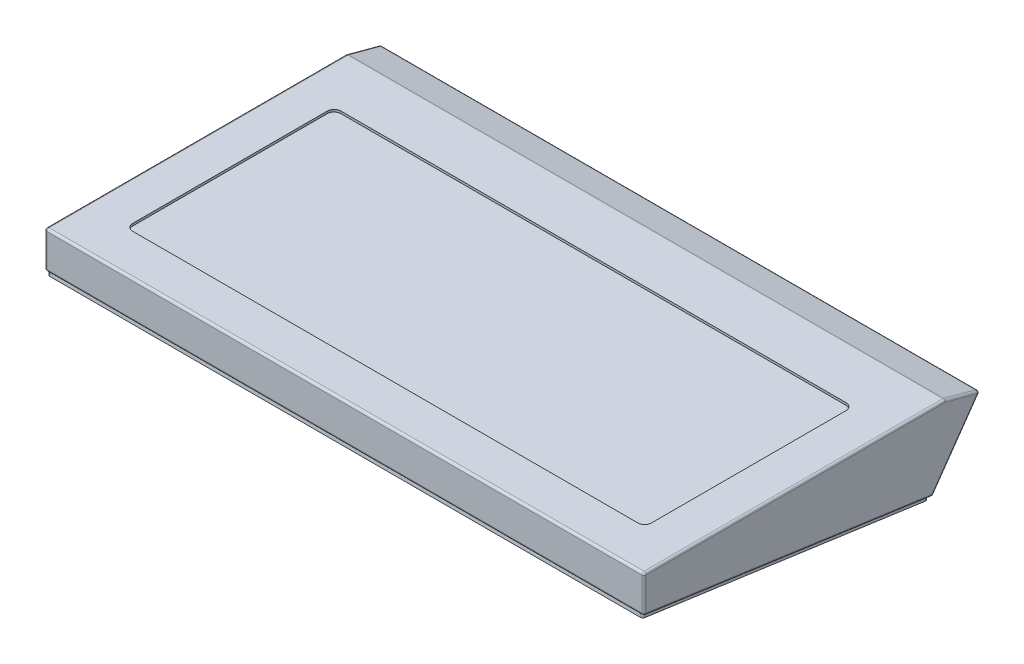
ISO-10303-21;
HEADER;
FILE_DESCRIPTION(('STEP AP214'),'2;1');
FILE_NAME('part.step','',(''),(''),'','','');
FILE_SCHEMA(('AUTOMOTIVE_DESIGN { 1 0 10303 214 1 1 1 1 }'));
ENDSEC;
DATA;
#1=APPLICATION_CONTEXT('core data for automotive mechanical design processes');
#2=APPLICATION_PROTOCOL_DEFINITION('international standard','automotive_design',2000,#1);
#3=PRODUCT_CONTEXT('',#1,'mechanical');
#4=PRODUCT('Part','Part','',(#3));
#5=PRODUCT_RELATED_PRODUCT_CATEGORY('part','',(#4));
#6=PRODUCT_DEFINITION_FORMATION('','',#4);
#7=PRODUCT_DEFINITION_CONTEXT('part definition',#1,'design');
#8=PRODUCT_DEFINITION('design','',#6,#7);
#9=PRODUCT_DEFINITION_SHAPE('','',#8);
#10=(LENGTH_UNIT() NAMED_UNIT(*) SI_UNIT(.MILLI.,.METRE.));
#11=(NAMED_UNIT(*) PLANE_ANGLE_UNIT() SI_UNIT($,.RADIAN.));
#12=(NAMED_UNIT(*) SI_UNIT($,.STERADIAN.) SOLID_ANGLE_UNIT());
#13=UNCERTAINTY_MEASURE_WITH_UNIT(LENGTH_MEASURE(1.E-05),#10,'distance_accuracy_value','');
#14=(GEOMETRIC_REPRESENTATION_CONTEXT(3) GLOBAL_UNCERTAINTY_ASSIGNED_CONTEXT((#13)) GLOBAL_UNIT_ASSIGNED_CONTEXT((#10,
#11,#12)) REPRESENTATION_CONTEXT('',''));
#15=CARTESIAN_POINT('',(0.,0.,0.));
#16=DIRECTION('',(0.,0.,1.));
#17=DIRECTION('',(1.,0.,0.));
#18=AXIS2_PLACEMENT_3D('',#15,#16,#17);
#19=CARTESIAN_POINT('',(208.28,-53.8956194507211,8.60043604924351));
#20=DIRECTION('',(0.,0.99026806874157,-0.139173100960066));
#21=DIRECTION('',(0.,0.139173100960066,0.99026806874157));
#22=AXIS2_PLACEMENT_3D('',#19,#20,#21);
#23=PLANE('',#22);
#24=CARTESIAN_POINT('',(-205.232,-53.4134144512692,12.031502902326));
#25=DIRECTION('',(0.,-0.99026806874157,0.139173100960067));
#26=DIRECTION('',(0.,-0.139173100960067,-0.99026806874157));
#27=AXIS2_PLACEMENT_3D('',#24,#25,#26);
#28=CIRCLE('',#27,1.524);
#29=CARTESIAN_POINT('',(-206.756,-53.4134144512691,12.031502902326));
#30=VERTEX_POINT('',#29);
#31=CARTESIAN_POINT('',(-205.232,-53.6255142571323,10.5223343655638));
#32=VERTEX_POINT('',#31);
#33=EDGE_CURVE('E293',#30,#32,#28,.T.);
#34=ORIENTED_EDGE('',*,*,#33,.F.);
#35=DIRECTION('',(0.,-0.139173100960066,-0.99026806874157));
#36=VECTOR('',#35,1.);
#37=CARTESIAN_POINT('',(-206.756,-53.8956194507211,8.60043604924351));
#38=LINE('',#37,#36);
#39=CARTESIAN_POINT('',(-206.756,-53.7656445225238,9.52525571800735));
#40=VERTEX_POINT('',#39);
#41=EDGE_CURVE('E446',#30,#40,#38,.T.);
#42=ORIENTED_EDGE('',*,*,#41,.T.);
#43=DIRECTION('',(-1.,0.,0.));
#44=VECTOR('',#43,1.);
#45=CARTESIAN_POINT('',(208.28,-53.7656445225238,9.52525571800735));
#46=LINE('',#45,#44);
#47=CARTESIAN_POINT('',(206.756,-53.7656445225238,9.52525571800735));
#48=VERTEX_POINT('',#47);
#49=EDGE_CURVE('E444',#40,#48,#46,.F.);
#50=ORIENTED_EDGE('',*,*,#49,.T.);
#51=DIRECTION('',(0.,-0.139173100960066,-0.99026806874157));
#52=VECTOR('',#51,1.);
#53=CARTESIAN_POINT('',(206.756,-53.8956194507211,8.60043604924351));
#54=LINE('',#53,#52);
#55=CARTESIAN_POINT('',(206.756,-53.4134144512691,12.031502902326));
#56=VERTEX_POINT('',#55);
#57=EDGE_CURVE('E451',#48,#56,#54,.F.);
#58=ORIENTED_EDGE('',*,*,#57,.T.);
#59=CARTESIAN_POINT('',(205.232,-53.4134144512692,12.031502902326));
#60=DIRECTION('',(0.,-0.99026806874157,0.139173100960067));
#61=DIRECTION('',(0.,0.139173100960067,0.99026806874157));
#62=AXIS2_PLACEMENT_3D('',#59,#60,#61);
#63=CIRCLE('',#62,1.52399999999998);
#64=CARTESIAN_POINT('',(205.232,-53.6255142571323,10.5223343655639));
#65=VERTEX_POINT('',#64);
#66=EDGE_CURVE('E52',#65,#56,#63,.T.);
#67=ORIENTED_EDGE('',*,*,#66,.F.);
#68=DIRECTION('',(1.,0.,0.));
#69=VECTOR('',#68,1.);
#70=CARTESIAN_POINT('',(205.232,-53.6255142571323,10.5223343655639));
#71=LINE('',#70,#69);
#72=EDGE_CURVE('E47',#32,#65,#71,.T.);
#73=ORIENTED_EDGE('',*,*,#72,.F.);
#74=EDGE_LOOP('',(#34,#42,#50,#58,#67,#73));
#75=FACE_BOUND('',#74,.T.);
#76=ADVANCED_FACE('F32',(#75),#23,.F.);
#77=CARTESIAN_POINT('',(205.232,-25.9818395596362,207.217300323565));
#78=DIRECTION('',(0.,-0.99026806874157,0.139173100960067));
#79=DIRECTION('',(0.,-0.139173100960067,-0.99026806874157));
#80=AXIS2_PLACEMENT_3D('',#77,#78,#79);
#81=CIRCLE('',#80,1.52400000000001);
#82=CARTESIAN_POINT('',(206.756,-25.9818395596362,207.217300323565));
#83=VERTEX_POINT('',#82);
#84=CARTESIAN_POINT('',(206.354480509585,-25.8383755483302,208.238099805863));
#85=VERTEX_POINT('',#84);
#86=EDGE_CURVE('E323',#83,#85,#81,.T.);
#87=ORIENTED_EDGE('',*,*,#86,.F.);
#88=CARTESIAN_POINT('',(206.756,-25.8383755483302,208.238099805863));
#89=VERTEX_POINT('',#88);
#90=EDGE_CURVE('E450',#83,#89,#54,.F.);
#91=ORIENTED_EDGE('',*,*,#90,.T.);
#92=DIRECTION('',(-1.,0.,0.));
#93=VECTOR('',#92,1.);
#94=CARTESIAN_POINT('',(208.28,-25.8383755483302,208.238099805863));
#95=LINE('',#94,#93);
#96=EDGE_CURVE('E454',#89,#85,#95,.T.);
#97=ORIENTED_EDGE('',*,*,#96,.T.);
#98=EDGE_LOOP('',(#87,#91,#97));
#99=FACE_BOUND('',#98,.T.);
#100=ADVANCED_FACE('F716',(#99),#23,.F.);
#101=CARTESIAN_POINT('',(-205.232,-25.9818395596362,207.217300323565));
#102=DIRECTION('',(0.,-0.99026806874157,0.139173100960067));
#103=DIRECTION('',(0.,-0.139173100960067,-0.99026806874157));
#104=AXIS2_PLACEMENT_3D('',#101,#102,#103);
#105=CIRCLE('',#104,1.52400000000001);
#106=CARTESIAN_POINT('',(-206.354480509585,-25.8383755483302,208.238099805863));
#107=VERTEX_POINT('',#106);
#108=CARTESIAN_POINT('',(-206.756,-25.9818395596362,207.217300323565));
#109=VERTEX_POINT('',#108);
#110=EDGE_CURVE('E328',#107,#109,#105,.T.);
#111=ORIENTED_EDGE('',*,*,#110,.F.);
#112=CARTESIAN_POINT('',(-206.756,-25.8383755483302,208.238099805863));
#113=VERTEX_POINT('',#112);
#114=EDGE_CURVE('E453',#107,#113,#95,.T.);
#115=ORIENTED_EDGE('',*,*,#114,.T.);
#116=EDGE_CURVE('E447',#113,#109,#38,.T.);
#117=ORIENTED_EDGE('',*,*,#116,.T.);
#118=EDGE_LOOP('',(#111,#115,#117));
#119=FACE_BOUND('',#118,.T.);
#120=ADVANCED_FACE('F718',(#119),#23,.F.);
#121=CARTESIAN_POINT('',(208.28,0.,0.));
#122=DIRECTION('',(0.,-0.96592582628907,0.258819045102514));
#123=DIRECTION('',(0.,-0.258819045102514,-0.96592582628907));
#124=AXIS2_PLACEMENT_3D('',#121,#122,#123);
#125=PLANE('',#124);
#126=DIRECTION('',(0.,0.258819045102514,0.96592582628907));
#127=VECTOR('',#126,1.);
#128=CARTESIAN_POINT('',(206.756,0.,0.));
#129=LINE('',#128,#127);
#130=CARTESIAN_POINT('',(206.756,-0.0519290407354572,-0.193801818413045));
#131=VERTEX_POINT('',#130);
#132=CARTESIAN_POINT('',(206.756,-6.0106847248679,-22.4321807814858));
#133=VERTEX_POINT('',#132);
#134=EDGE_CURVE('E479',#131,#133,#129,.F.);
#135=ORIENTED_EDGE('',*,*,#134,.T.);
#136=DIRECTION('',(-1.,0.,0.));
#137=VECTOR('',#136,1.);
#138=CARTESIAN_POINT('',(208.28,-6.0106847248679,-22.4321807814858));
#139=LINE('',#138,#137);
#140=CARTESIAN_POINT('',(-206.756,-6.0106847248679,-22.4321807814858));
#141=VERTEX_POINT('',#140);
#142=EDGE_CURVE('E481',#133,#141,#139,.T.);
#143=ORIENTED_EDGE('',*,*,#142,.T.);
#144=DIRECTION('',(0.,0.258819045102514,0.96592582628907));
#145=VECTOR('',#144,1.);
#146=CARTESIAN_POINT('',(-206.756,0.,0.));
#147=LINE('',#146,#145);
#148=CARTESIAN_POINT('',(-206.756,-0.0519290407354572,-0.193801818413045));
#149=VERTEX_POINT('',#148);
#150=EDGE_CURVE('E475',#141,#149,#147,.T.);
#151=ORIENTED_EDGE('',*,*,#150,.T.);
#152=DIRECTION('',(-1.,0.,0.));
#153=VECTOR('',#152,1.);
#154=CARTESIAN_POINT('',(208.28,-0.0519290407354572,-0.193801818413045));
#155=LINE('',#154,#153);
#156=EDGE_CURVE('E477',#149,#131,#155,.F.);
#157=ORIENTED_EDGE('',*,*,#156,.T.);
#158=EDGE_LOOP('',(#135,#143,#151,#157));
#159=FACE_BOUND('',#158,.T.);
#160=ADVANCED_FACE('F725',(#159),#125,.F.);
#161=CARTESIAN_POINT('',(208.28,0.,0.));
#162=DIRECTION('',(0.,-1.,0.));
#163=DIRECTION('',(0.,0.,-1.));
#164=AXIS2_PLACEMENT_3D('',#161,#162,#163);
#165=PLANE('',#164);
#166=DIRECTION('',(1.,0.,0.));
#167=VECTOR('',#166,1.);
#168=CARTESIAN_POINT('',(-175.5648,0.,181.102));
#169=LINE('',#168,#167);
#170=CARTESIAN_POINT('',(-175.5648,0.,181.102));
#171=VERTEX_POINT('',#170);
#172=CARTESIAN_POINT('',(175.5648,0.,181.102));
#173=VERTEX_POINT('',#172);
#174=EDGE_CURVE('E386',#171,#173,#169,.T.);
#175=ORIENTED_EDGE('',*,*,#174,.F.);
#176=CARTESIAN_POINT('',(-175.5648,0.,176.3268));
#177=DIRECTION('',(0.,1.,0.));
#178=DIRECTION('',(0.,0.,1.));
#179=AXIS2_PLACEMENT_3D('',#176,#177,#178);
#180=CIRCLE('',#179,4.77520000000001);
#181=CARTESIAN_POINT('',(-180.34,0.,176.3268));
#182=VERTEX_POINT('',#181);
#183=EDGE_CURVE('E358',#182,#171,#180,.T.);
#184=ORIENTED_EDGE('',*,*,#183,.F.);
#185=DIRECTION('',(0.,0.,1.));
#186=VECTOR('',#185,1.);
#187=CARTESIAN_POINT('',(-180.34,0.,41.0972));
#188=LINE('',#187,#186);
#189=CARTESIAN_POINT('',(-180.34,0.,41.0972));
#190=VERTEX_POINT('',#189);
#191=EDGE_CURVE('E363',#190,#182,#188,.T.);
#192=ORIENTED_EDGE('',*,*,#191,.F.);
#193=CARTESIAN_POINT('',(-175.5648,0.,41.0972));
#194=DIRECTION('',(0.,1.,0.));
#195=DIRECTION('',(0.,0.,1.));
#196=AXIS2_PLACEMENT_3D('',#193,#194,#195);
#197=CIRCLE('',#196,4.77520000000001);
#198=CARTESIAN_POINT('',(-175.5648,0.,36.322));
#199=VERTEX_POINT('',#198);
#200=EDGE_CURVE('E401',#199,#190,#197,.T.);
#201=ORIENTED_EDGE('',*,*,#200,.F.);
#202=DIRECTION('',(-1.,0.,0.));
#203=VECTOR('',#202,1.);
#204=CARTESIAN_POINT('',(-175.5648,0.,36.322));
#205=LINE('',#204,#203);
#206=CARTESIAN_POINT('',(175.5648,0.,36.322));
#207=VERTEX_POINT('',#206);
#208=EDGE_CURVE('E398',#207,#199,#205,.T.);
#209=ORIENTED_EDGE('',*,*,#208,.F.);
#210=CARTESIAN_POINT('',(175.5648,0.,41.0972));
#211=DIRECTION('',(0.,1.,0.));
#212=DIRECTION('',(0.,0.,-1.));
#213=AXIS2_PLACEMENT_3D('',#210,#211,#212);
#214=CIRCLE('',#213,4.77520000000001);
#215=CARTESIAN_POINT('',(180.34,0.,41.0972));
#216=VERTEX_POINT('',#215);
#217=EDGE_CURVE('E395',#216,#207,#214,.T.);
#218=ORIENTED_EDGE('',*,*,#217,.F.);
#219=DIRECTION('',(0.,0.,-1.));
#220=VECTOR('',#219,1.);
#221=CARTESIAN_POINT('',(180.34,0.,41.0972));
#222=LINE('',#221,#220);
#223=CARTESIAN_POINT('',(180.34,0.,176.3268));
#224=VERTEX_POINT('',#223);
#225=EDGE_CURVE('E392',#224,#216,#222,.T.);
#226=ORIENTED_EDGE('',*,*,#225,.F.);
#227=CARTESIAN_POINT('',(175.5648,0.,176.3268));
#228=DIRECTION('',(0.,1.,0.));
#229=DIRECTION('',(0.,0.,1.));
#230=AXIS2_PLACEMENT_3D('',#227,#228,#229);
#231=CIRCLE('',#230,4.77520000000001);
#232=EDGE_CURVE('E389',#173,#224,#231,.T.);
#233=ORIENTED_EDGE('',*,*,#232,.F.);
#234=EDGE_LOOP('',(#175,#184,#192,#201,#209,#218,#226,#233));
#235=FACE_BOUND('',#234,.T.);
#236=DIRECTION('',(-1.,0.,0.));
#237=VECTOR('',#236,1.);
#238=CARTESIAN_POINT('',(208.28,0.,208.026));
#239=LINE('',#238,#237);
#240=CARTESIAN_POINT('',(-206.756,0.,208.026));
#241=VERTEX_POINT('',#240);
#242=CARTESIAN_POINT('',(206.756,0.,208.026));
#243=VERTEX_POINT('',#242);
#244=EDGE_CURVE('E468',#241,#243,#239,.F.);
#245=ORIENTED_EDGE('',*,*,#244,.T.);
#246=DIRECTION('',(0.,0.,1.));
#247=VECTOR('',#246,1.);
#248=CARTESIAN_POINT('',(206.756,0.,0.));
#249=LINE('',#248,#247);
#250=CARTESIAN_POINT('',(206.756,0.,0.200638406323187));
#251=VERTEX_POINT('',#250);
#252=EDGE_CURVE('E472',#243,#251,#249,.F.);
#253=ORIENTED_EDGE('',*,*,#252,.T.);
#254=DIRECTION('',(-1.,0.,0.));
#255=VECTOR('',#254,1.);
#256=CARTESIAN_POINT('',(208.28,0.,0.200638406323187));
#257=LINE('',#256,#255);
#258=CARTESIAN_POINT('',(-206.756,0.,0.200638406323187));
#259=VERTEX_POINT('',#258);
#260=EDGE_CURVE('E470',#251,#259,#257,.T.);
#261=ORIENTED_EDGE('',*,*,#260,.T.);
#262=DIRECTION('',(0.,0.,1.));
#263=VECTOR('',#262,1.);
#264=CARTESIAN_POINT('',(-206.756,0.,209.55));
#265=LINE('',#264,#263);
#266=EDGE_CURVE('E466',#259,#241,#265,.T.);
#267=ORIENTED_EDGE('',*,*,#266,.T.);
#268=EDGE_LOOP('',(#245,#253,#261,#267));
#269=FACE_BOUND('',#268,.T.);
#270=ADVANCED_FACE('F730',(#235,#269),#165,.F.);
#271=CARTESIAN_POINT('',(208.28,0.,209.55));
#272=DIRECTION('',(0.,0.,-1.));
#273=DIRECTION('',(0.,1.,0.));
#274=AXIS2_PLACEMENT_3D('',#271,#272,#273);
#275=PLANE('',#274);
#276=DIRECTION('',(0.,-1.,0.));
#277=VECTOR('',#276,1.);
#278=CARTESIAN_POINT('',(-206.756,-25.654,209.55));
#279=LINE('',#278,#277);
#280=CARTESIAN_POINT('',(-206.756,-1.52400000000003,209.55));
#281=VERTEX_POINT('',#280);
#282=CARTESIAN_POINT('',(-206.756,-24.3292070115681,209.55));
#283=VERTEX_POINT('',#282);
#284=EDGE_CURVE('E459',#281,#283,#279,.T.);
#285=ORIENTED_EDGE('',*,*,#284,.T.);
#286=DIRECTION('',(-1.,0.,0.));
#287=VECTOR('',#286,1.);
#288=CARTESIAN_POINT('',(208.28,-24.3292070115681,209.55));
#289=LINE('',#288,#287);
#290=CARTESIAN_POINT('',(206.756,-24.3292070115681,209.55));
#291=VERTEX_POINT('',#290);
#292=EDGE_CURVE('E464',#283,#291,#289,.F.);
#293=ORIENTED_EDGE('',*,*,#292,.T.);
#294=DIRECTION('',(0.,-1.,0.));
#295=VECTOR('',#294,1.);
#296=CARTESIAN_POINT('',(206.756,0.,209.55));
#297=LINE('',#296,#295);
#298=CARTESIAN_POINT('',(206.756,-1.52400000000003,209.55));
#299=VERTEX_POINT('',#298);
#300=EDGE_CURVE('E461',#291,#299,#297,.F.);
#301=ORIENTED_EDGE('',*,*,#300,.T.);
#302=DIRECTION('',(-1.,0.,0.));
#303=VECTOR('',#302,1.);
#304=CARTESIAN_POINT('',(208.28,-1.52400000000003,209.55));
#305=LINE('',#304,#303);
#306=EDGE_CURVE('E457',#299,#281,#305,.T.);
#307=ORIENTED_EDGE('',*,*,#306,.T.);
#308=EDGE_LOOP('',(#285,#293,#301,#307));
#309=FACE_BOUND('',#308,.T.);
#310=ADVANCED_FACE('F599',(#309),#275,.F.);
#311=CARTESIAN_POINT('',(208.28,-6.57400374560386,-24.5345159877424));
#312=DIRECTION('',(0.,0.573576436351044,0.819152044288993));
#313=DIRECTION('',(0.,-0.819152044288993,0.573576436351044));
#314=AXIS2_PLACEMENT_3D('',#311,#312,#313);
#315=PLANE('',#314);
#316=CARTESIAN_POINT('',(177.8,-15.7214808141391,-18.1293835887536));
#317=DIRECTION('',(0.,-0.573576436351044,-0.819152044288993));
#318=DIRECTION('',(0.,0.819152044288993,-0.573576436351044));
#319=AXIS2_PLACEMENT_3D('',#316,#317,#318);
#320=CIRCLE('',#319,2.5);
#321=CARTESIAN_POINT('',(177.8,-13.6736007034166,-19.5633246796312));
#322=VERTEX_POINT('',#321);
#323=EDGE_CURVE('E261',#322,#322,#320,.T.);
#324=ORIENTED_EDGE('',*,*,#323,.F.);
#325=EDGE_LOOP('',(#324));
#326=FACE_BOUND('',#325,.T.);
#327=CARTESIAN_POINT('',(177.8,-45.766011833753,2.90802351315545));
#328=DIRECTION('',(0.,-0.573576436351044,-0.819152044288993));
#329=DIRECTION('',(0.,0.819152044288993,-0.573576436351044));
#330=AXIS2_PLACEMENT_3D('',#327,#328,#329);
#331=CIRCLE('',#330,2.5);
#332=CARTESIAN_POINT('',(177.8,-43.7181317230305,1.47408242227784));
#333=VERTEX_POINT('',#332);
#334=EDGE_CURVE('E260',#333,#333,#331,.T.);
#335=ORIENTED_EDGE('',*,*,#334,.F.);
#336=EDGE_LOOP('',(#335));
#337=FACE_BOUND('',#336,.T.);
#338=CARTESIAN_POINT('',(-177.8,-45.766011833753,2.90802351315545));
#339=DIRECTION('',(0.,-0.573576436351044,-0.819152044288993));
#340=DIRECTION('',(0.,0.819152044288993,-0.573576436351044));
#341=AXIS2_PLACEMENT_3D('',#338,#339,#340);
#342=CIRCLE('',#341,2.5);
#343=CARTESIAN_POINT('',(-177.8,-43.7181317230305,1.47408242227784));
#344=VERTEX_POINT('',#343);
#345=EDGE_CURVE('E271',#344,#344,#342,.T.);
#346=ORIENTED_EDGE('',*,*,#345,.F.);
#347=EDGE_LOOP('',(#346));
#348=FACE_BOUND('',#347,.T.);
#349=CARTESIAN_POINT('',(-177.8,-15.721480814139,-18.1293835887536));
#350=DIRECTION('',(0.,-0.573576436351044,-0.819152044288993));
#351=DIRECTION('',(0.,0.819152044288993,-0.573576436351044));
#352=AXIS2_PLACEMENT_3D('',#349,#350,#351);
#353=CIRCLE('',#352,2.5);
#354=CARTESIAN_POINT('',(-177.8,-13.6736007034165,-19.5633246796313));
#355=VERTEX_POINT('',#354);
#356=EDGE_CURVE('E277',#355,#355,#353,.T.);
#357=ORIENTED_EDGE('',*,*,#356,.F.);
#358=EDGE_LOOP('',(#357));
#359=FACE_BOUND('',#358,.T.);
#360=CARTESIAN_POINT('',(0.,-30.743746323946,-7.61068003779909));
#361=DIRECTION('',(0.,0.573576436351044,0.819152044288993));
#362=DIRECTION('',(0.,-0.819152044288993,0.573576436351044));
#363=AXIS2_PLACEMENT_3D('',#360,#361,#362);
#364=CIRCLE('',#363,8.382);
#365=CARTESIAN_POINT('',(0.,-37.6098787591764,-2.80296234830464));
#366=VERTEX_POINT('',#365);
#367=EDGE_CURVE('E286',#366,#366,#364,.T.);
#368=ORIENTED_EDGE('',*,*,#367,.T.);
#369=EDGE_LOOP('',(#368));
#370=FACE_BOUND('',#369,.T.);
#371=DIRECTION('',(-1.,0.,0.));
#372=VECTOR('',#371,1.);
#373=CARTESIAN_POINT('',(208.28,-8.35688617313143,-23.286128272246));
#374=LINE('',#373,#372);
#375=CARTESIAN_POINT('',(-206.756,-8.35688617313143,-23.286128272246));
#376=VERTEX_POINT('',#375);
#377=CARTESIAN_POINT('',(206.756,-8.35688617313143,-23.286128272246));
#378=VERTEX_POINT('',#377);
#379=EDGE_CURVE('E439',#376,#378,#374,.F.);
#380=ORIENTED_EDGE('',*,*,#379,.T.);
#381=DIRECTION('',(0.,0.819152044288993,-0.573576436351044));
#382=VECTOR('',#381,1.);
#383=CARTESIAN_POINT('',(206.756,-6.57400374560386,-24.5345159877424));
#384=LINE('',#383,#382);
#385=CARTESIAN_POINT('',(206.756,-53.1306064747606,8.06476819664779));
#386=VERTEX_POINT('',#385);
#387=EDGE_CURVE('E441',#378,#386,#384,.F.);
#388=ORIENTED_EDGE('',*,*,#387,.T.);
#389=DIRECTION('',(-1.,0.,0.));
#390=VECTOR('',#389,1.);
#391=CARTESIAN_POINT('',(208.28,-53.1306064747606,8.06476819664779));
#392=LINE('',#391,#390);
#393=CARTESIAN_POINT('',(-206.756,-53.1306064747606,8.06476819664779));
#394=VERTEX_POINT('',#393);
#395=EDGE_CURVE('E437',#386,#394,#392,.T.);
#396=ORIENTED_EDGE('',*,*,#395,.T.);
#397=DIRECTION('',(0.,0.819152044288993,-0.573576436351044));
#398=VECTOR('',#397,1.);
#399=CARTESIAN_POINT('',(-206.756,-6.57400374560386,-24.5345159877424));
#400=LINE('',#399,#398);
#401=EDGE_CURVE('E435',#394,#376,#400,.T.);
#402=ORIENTED_EDGE('',*,*,#401,.T.);
#403=EDGE_LOOP('',(#380,#388,#396,#402));
#404=FACE_BOUND('',#403,.T.);
#405=ADVANCED_FACE('F595',(#326,#337,#348,#359,#370,#404),#315,.F.);
#406=CARTESIAN_POINT('',(208.28,0.,0.));
#407=DIRECTION('',(-1.,0.,0.));
#408=DIRECTION('',(0.,0.,1.));
#409=AXIS2_PLACEMENT_3D('',#406,#407,#408);
#410=PLANE('',#409);
#411=DIRECTION('',(0.,-0.139173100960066,-0.99026806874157));
#412=VECTOR('',#411,1.);
#413=CARTESIAN_POINT('',(208.28,-52.5278391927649,7.38230636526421));
#414=LINE('',#413,#412);
#415=CARTESIAN_POINT('',(208.28,-24.3292070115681,208.026));
#416=VERTEX_POINT('',#415);
#417=CARTESIAN_POINT('',(208.28,-52.2564759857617,9.31315591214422));
#418=VERTEX_POINT('',#417);
#419=EDGE_CURVE('E430',#416,#418,#414,.T.);
#420=ORIENTED_EDGE('',*,*,#419,.T.);
#421=DIRECTION('',(0.,0.819152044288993,-0.573576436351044));
#422=VECTOR('',#421,1.);
#423=CARTESIAN_POINT('',(208.28,-12.8161023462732,-18.303291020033));
#424=LINE('',#423,#422);
#425=CARTESIAN_POINT('',(208.28,-7.48275568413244,-22.0377405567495));
#426=VERTEX_POINT('',#425);
#427=EDGE_CURVE('E432',#418,#426,#424,.T.);
#428=ORIENTED_EDGE('',*,*,#427,.T.);
#429=DIRECTION('',(0.,0.258819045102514,0.96592582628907));
#430=VECTOR('',#429,1.);
#431=CARTESIAN_POINT('',(208.28,-1.47207095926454,0.394440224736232));
#432=LINE('',#431,#430);
#433=CARTESIAN_POINT('',(208.28,-1.524,0.200638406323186));
#434=VERTEX_POINT('',#433);
#435=EDGE_CURVE('E423',#426,#434,#432,.T.);
#436=ORIENTED_EDGE('',*,*,#435,.T.);
#437=DIRECTION('',(0.,0.,1.));
#438=VECTOR('',#437,1.);
#439=CARTESIAN_POINT('',(208.28,-1.524,0.));
#440=LINE('',#439,#438);
#441=CARTESIAN_POINT('',(208.28,-1.52400000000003,208.026));
#442=VERTEX_POINT('',#441);
#443=EDGE_CURVE('E425',#434,#442,#440,.T.);
#444=ORIENTED_EDGE('',*,*,#443,.T.);
#445=DIRECTION('',(0.,-1.,0.));
#446=VECTOR('',#445,1.);
#447=CARTESIAN_POINT('',(208.28,-6.75202468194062E-13,208.026));
#448=LINE('',#447,#446);
#449=EDGE_CURVE('E428',#442,#416,#448,.T.);
#450=ORIENTED_EDGE('',*,*,#449,.T.);
#451=EDGE_LOOP('',(#420,#428,#436,#444,#450));
#452=FACE_BOUND('',#451,.T.);
#453=ADVANCED_FACE('F598',(#452),#410,.F.);
#454=CARTESIAN_POINT('',(-208.28,0.,0.));
#455=DIRECTION('',(-1.,0.,0.));
#456=DIRECTION('',(0.,0.,1.));
#457=AXIS2_PLACEMENT_3D('',#454,#455,#456);
#458=PLANE('',#457);
#459=DIRECTION('',(0.,0.819152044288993,-0.573576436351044));
#460=VECTOR('',#459,1.);
#461=CARTESIAN_POINT('',(-208.28,-53.0214889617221,9.84882376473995));
#462=LINE('',#461,#460);
#463=CARTESIAN_POINT('',(-208.28,-7.48275568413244,-22.0377405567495));
#464=VERTEX_POINT('',#463);
#465=CARTESIAN_POINT('',(-208.28,-52.2564759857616,9.31315591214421));
#466=VERTEX_POINT('',#465);
#467=EDGE_CURVE('E491',#464,#466,#462,.F.);
#468=ORIENTED_EDGE('',*,*,#467,.T.);
#469=DIRECTION('',(0.,-0.139173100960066,-0.99026806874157));
#470=VECTOR('',#469,1.);
#471=CARTESIAN_POINT('',(-208.28,-24.1448314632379,209.337900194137));
#472=LINE('',#471,#470);
#473=CARTESIAN_POINT('',(-208.28,-24.3292070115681,208.026));
#474=VERTEX_POINT('',#473);
#475=EDGE_CURVE('E493',#466,#474,#472,.F.);
#476=ORIENTED_EDGE('',*,*,#475,.T.);
#477=DIRECTION('',(0.,-1.,0.));
#478=VECTOR('',#477,1.);
#479=CARTESIAN_POINT('',(-208.28,0.,208.026));
#480=LINE('',#479,#478);
#481=CARTESIAN_POINT('',(-208.28,-1.52400000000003,208.026));
#482=VERTEX_POINT('',#481);
#483=EDGE_CURVE('E486',#474,#482,#480,.F.);
#484=ORIENTED_EDGE('',*,*,#483,.T.);
#485=DIRECTION('',(0.,0.,1.));
#486=VECTOR('',#485,1.);
#487=CARTESIAN_POINT('',(-208.28,-1.524,0.));
#488=LINE('',#487,#486);
#489=CARTESIAN_POINT('',(-208.28,-1.524,0.200638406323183));
#490=VERTEX_POINT('',#489);
#491=EDGE_CURVE('E484',#482,#490,#488,.F.);
#492=ORIENTED_EDGE('',*,*,#491,.T.);
#493=DIRECTION('',(0.,0.258819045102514,0.96592582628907));
#494=VECTOR('',#493,1.);
#495=CARTESIAN_POINT('',(-208.28,-8.04607470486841,-24.1400757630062));
#496=LINE('',#495,#494);
#497=EDGE_CURVE('E488',#490,#464,#496,.F.);
#498=ORIENTED_EDGE('',*,*,#497,.T.);
#499=EDGE_LOOP('',(#468,#476,#484,#492,#498));
#500=FACE_BOUND('',#499,.T.);
#501=ADVANCED_FACE('F656',(#500),#458,.T.);
#502=CARTESIAN_POINT('',(-206.756,-1.52400000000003,208.026));
#503=DIRECTION('',(0.,0.,1.));
#504=DIRECTION('',(1.,0.,0.));
#505=AXIS2_PLACEMENT_3D('',#502,#503,#504);
#506=SPHERICAL_SURFACE('',#505,1.524);
#507=CARTESIAN_POINT('',(-206.756,-1.52400000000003,208.026));
#508=DIRECTION('',(0.,0.,1.));
#509=DIRECTION('',(1.,0.,0.));
#510=AXIS2_PLACEMENT_3D('',#507,#508,#509);
#511=CIRCLE('',#510,1.524);
#512=EDGE_CURVE('E570',#482,#241,#511,.F.);
#513=ORIENTED_EDGE('',*,*,#512,.F.);
#514=CARTESIAN_POINT('',(-206.756,-1.52400000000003,208.026));
#515=DIRECTION('',(0.,1.,0.));
#516=DIRECTION('',(0.,0.,1.));
#517=AXIS2_PLACEMENT_3D('',#514,#515,#516);
#518=CIRCLE('',#517,1.524);
#519=EDGE_CURVE('E426',#281,#482,#518,.F.);
#520=ORIENTED_EDGE('',*,*,#519,.F.);
#521=CARTESIAN_POINT('',(-206.756,-1.52400000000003,208.026));
#522=DIRECTION('',(-1.,0.,0.));
#523=DIRECTION('',(0.,0.,1.));
#524=AXIS2_PLACEMENT_3D('',#521,#522,#523);
#525=CIRCLE('',#524,1.524);
#526=EDGE_CURVE('E573',#241,#281,#525,.F.);
#527=ORIENTED_EDGE('',*,*,#526,.F.);
#528=EDGE_LOOP('',(#513,#520,#527));
#529=FACE_BOUND('',#528,.T.);
#530=ADVANCED_FACE('F689',(#529),#506,.T.);
#531=CARTESIAN_POINT('',(-206.756,0.,208.026));
#532=DIRECTION('',(0.,1.,0.));
#533=DIRECTION('',(0.,0.,1.));
#534=AXIS2_PLACEMENT_3D('',#531,#532,#533);
#535=CYLINDRICAL_SURFACE('',#534,1.524);
#536=ORIENTED_EDGE('',*,*,#519,.T.);
#537=ORIENTED_EDGE('',*,*,#483,.F.);
#538=CARTESIAN_POINT('',(-206.756,-24.3292070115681,208.026));
#539=DIRECTION('',(0.,-1.,0.));
#540=DIRECTION('',(0.,0.,-1.));
#541=AXIS2_PLACEMENT_3D('',#538,#539,#540);
#542=CIRCLE('',#541,1.524);
#543=EDGE_CURVE('E567',#283,#474,#542,.T.);
#544=ORIENTED_EDGE('',*,*,#543,.F.);
#545=ORIENTED_EDGE('',*,*,#284,.F.);
#546=EDGE_LOOP('',(#536,#537,#544,#545));
#547=FACE_BOUND('',#546,.T.);
#548=ADVANCED_FACE('F659',(#547),#535,.T.);
#549=CARTESIAN_POINT('',(208.28,-1.52400000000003,208.026));
#550=DIRECTION('',(-1.,0.,0.));
#551=DIRECTION('',(0.,0.,1.));
#552=AXIS2_PLACEMENT_3D('',#549,#550,#551);
#553=CYLINDRICAL_SURFACE('',#552,1.524);
#554=ORIENTED_EDGE('',*,*,#526,.T.);
#555=ORIENTED_EDGE('',*,*,#306,.F.);
#556=CARTESIAN_POINT('',(206.756,-1.52400000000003,208.026));
#557=DIRECTION('',(1.,0.,0.));
#558=DIRECTION('',(0.,0.,-1.));
#559=AXIS2_PLACEMENT_3D('',#556,#557,#558);
#560=CIRCLE('',#559,1.524);
#561=EDGE_CURVE('E564',#243,#299,#560,.T.);
#562=ORIENTED_EDGE('',*,*,#561,.F.);
#563=ORIENTED_EDGE('',*,*,#244,.F.);
#564=EDGE_LOOP('',(#554,#555,#562,#563));
#565=FACE_BOUND('',#564,.T.);
#566=ADVANCED_FACE('F686',(#565),#553,.T.);
#567=CARTESIAN_POINT('',(-206.756,-1.524,0.));
#568=DIRECTION('',(0.,0.,-1.));
#569=DIRECTION('',(0.,1.,0.));
#570=AXIS2_PLACEMENT_3D('',#567,#568,#569);
#571=CYLINDRICAL_SURFACE('',#570,1.524);
#572=ORIENTED_EDGE('',*,*,#512,.T.);
#573=ORIENTED_EDGE('',*,*,#266,.F.);
#574=CARTESIAN_POINT('',(-206.756,-1.524,0.200638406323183));
#575=DIRECTION('',(0.,0.,-1.));
#576=DIRECTION('',(0.,1.,0.));
#577=AXIS2_PLACEMENT_3D('',#574,#575,#576);
#578=CIRCLE('',#577,1.524);
#579=EDGE_CURVE('E561',#490,#259,#578,.T.);
#580=ORIENTED_EDGE('',*,*,#579,.F.);
#581=ORIENTED_EDGE('',*,*,#491,.F.);
#582=EDGE_LOOP('',(#572,#573,#580,#581));
#583=FACE_BOUND('',#582,.T.);
#584=ADVANCED_FACE('F694',(#583),#571,.T.);
#585=CARTESIAN_POINT('',(-206.756,-24.3292070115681,208.026));
#586=DIRECTION('',(0.,0.,1.));
#587=DIRECTION('',(1.,0.,0.));
#588=AXIS2_PLACEMENT_3D('',#585,#586,#587);
#589=SPHERICAL_SURFACE('',#588,1.524);
#590=CARTESIAN_POINT('',(-206.756,-24.3292070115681,208.026));
#591=DIRECTION('',(-1.,0.,0.));
#592=DIRECTION('',(0.,0.,1.));
#593=AXIS2_PLACEMENT_3D('',#590,#591,#592);
#594=CIRCLE('',#593,1.524);
#595=EDGE_CURVE('E555',#283,#113,#594,.F.);
#596=ORIENTED_EDGE('',*,*,#595,.F.);
#597=ORIENTED_EDGE('',*,*,#543,.T.);
#598=CARTESIAN_POINT('',(-206.756,-24.3292070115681,208.026));
#599=DIRECTION('',(0.,0.13917310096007,0.99026806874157));
#600=DIRECTION('',(0.,-0.99026806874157,0.13917310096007));
#601=AXIS2_PLACEMENT_3D('',#598,#599,#600);
#602=CIRCLE('',#601,1.524);
#603=EDGE_CURVE('E558',#113,#474,#602,.F.);
#604=ORIENTED_EDGE('',*,*,#603,.F.);
#605=EDGE_LOOP('',(#596,#597,#604));
#606=FACE_BOUND('',#605,.T.);
#607=ADVANCED_FACE('F665',(#606),#589,.T.);
#608=CARTESIAN_POINT('',(206.756,-1.52400000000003,208.026));
#609=DIRECTION('',(0.,0.,1.));
#610=DIRECTION('',(1.,0.,0.));
#611=AXIS2_PLACEMENT_3D('',#608,#609,#610);
#612=SPHERICAL_SURFACE('',#611,1.524);
#613=CARTESIAN_POINT('',(206.756,-1.52400000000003,208.026));
#614=DIRECTION('',(0.,0.,1.));
#615=DIRECTION('',(1.,0.,0.));
#616=AXIS2_PLACEMENT_3D('',#613,#614,#615);
#617=CIRCLE('',#616,1.524);
#618=EDGE_CURVE('E550',#243,#442,#617,.F.);
#619=ORIENTED_EDGE('',*,*,#618,.F.);
#620=ORIENTED_EDGE('',*,*,#561,.T.);
#621=CARTESIAN_POINT('',(206.756,-1.52400000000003,208.026));
#622=DIRECTION('',(0.,1.,0.));
#623=DIRECTION('',(0.,0.,1.));
#624=AXIS2_PLACEMENT_3D('',#621,#622,#623);
#625=CIRCLE('',#624,1.524);
#626=EDGE_CURVE('E553',#442,#299,#625,.F.);
#627=ORIENTED_EDGE('',*,*,#626,.F.);
#628=EDGE_LOOP('',(#619,#620,#627));
#629=FACE_BOUND('',#628,.T.);
#630=ADVANCED_FACE('F682',(#629),#612,.T.);
#631=CARTESIAN_POINT('',(-206.756,-1.524,0.200638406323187));
#632=DIRECTION('',(0.,0.,1.));
#633=DIRECTION('',(1.,0.,0.));
#634=AXIS2_PLACEMENT_3D('',#631,#632,#633);
#635=SPHERICAL_SURFACE('',#634,1.524);
#636=CARTESIAN_POINT('',(-206.756,-1.524,0.200638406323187));
#637=DIRECTION('',(0.,0.258819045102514,0.96592582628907));
#638=DIRECTION('',(0.,-0.96592582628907,0.258819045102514));
#639=AXIS2_PLACEMENT_3D('',#636,#637,#638);
#640=CIRCLE('',#639,1.524);
#641=EDGE_CURVE('E544',#490,#149,#640,.F.);
#642=ORIENTED_EDGE('',*,*,#641,.F.);
#643=ORIENTED_EDGE('',*,*,#579,.T.);
#644=CARTESIAN_POINT('',(-206.756,-1.524,0.200638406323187));
#645=DIRECTION('',(-1.,0.,0.));
#646=DIRECTION('',(0.,0.,1.));
#647=AXIS2_PLACEMENT_3D('',#644,#645,#646);
#648=CIRCLE('',#647,1.524);
#649=EDGE_CURVE('E547',#149,#259,#648,.F.);
#650=ORIENTED_EDGE('',*,*,#649,.F.);
#651=EDGE_LOOP('',(#642,#643,#650));
#652=FACE_BOUND('',#651,.T.);
#653=ADVANCED_FACE('F858',(#652),#635,.T.);
#654=CARTESIAN_POINT('',(-206.756,-52.3864509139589,8.38833624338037));
#655=DIRECTION('',(0.,0.139173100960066,0.99026806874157));
#656=DIRECTION('',(0.,-0.99026806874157,0.139173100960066));
#657=AXIS2_PLACEMENT_3D('',#654,#655,#656);
#658=CYLINDRICAL_SURFACE('',#657,1.524);
#659=ORIENTED_EDGE('',*,*,#603,.T.);
#660=ORIENTED_EDGE('',*,*,#475,.F.);
#661=CARTESIAN_POINT('',(-206.756,-52.2564759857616,9.31315591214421));
#662=DIRECTION('',(0.,-0.139173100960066,-0.99026806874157));
#663=DIRECTION('',(0.,0.99026806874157,-0.139173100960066));
#664=AXIS2_PLACEMENT_3D('',#661,#662,#663);
#665=CIRCLE('',#664,1.524);
#666=EDGE_CURVE('E538',#40,#466,#665,.T.);
#667=ORIENTED_EDGE('',*,*,#666,.F.);
#668=ORIENTED_EDGE('',*,*,#41,.F.);
#669=DIRECTION('',(0.,-0.139173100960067,-0.99026806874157));
#670=VECTOR('',#669,1.);
#671=CARTESIAN_POINT('',(-206.756,-53.4134144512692,12.031502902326));
#672=LINE('',#671,#670);
#673=EDGE_CURVE('E300',#109,#30,#672,.T.);
#674=ORIENTED_EDGE('',*,*,#673,.F.);
#675=ORIENTED_EDGE('',*,*,#116,.F.);
#676=EDGE_LOOP('',(#659,#660,#667,#668,#674,#675));
#677=FACE_BOUND('',#676,.T.);
#678=ADVANCED_FACE('F651',(#677),#658,.T.);
#679=CARTESIAN_POINT('',(208.28,-24.3292070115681,208.026));
#680=DIRECTION('',(-1.,0.,0.));
#681=DIRECTION('',(0.,0.,1.));
#682=AXIS2_PLACEMENT_3D('',#679,#680,#681);
#683=CYLINDRICAL_SURFACE('',#682,1.524);
#684=ORIENTED_EDGE('',*,*,#595,.T.);
#685=ORIENTED_EDGE('',*,*,#114,.F.);
#686=DIRECTION('',(-1.,0.,0.));
#687=VECTOR('',#686,1.);
#688=CARTESIAN_POINT('',(208.28,-25.8383755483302,208.238099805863));
#689=LINE('',#688,#687);
#690=EDGE_CURVE('E356',#107,#85,#689,.F.);
#691=ORIENTED_EDGE('',*,*,#690,.T.);
#692=ORIENTED_EDGE('',*,*,#96,.F.);
#693=CARTESIAN_POINT('',(206.756,-24.3292070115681,208.026));
#694=DIRECTION('',(1.,0.,0.));
#695=DIRECTION('',(0.,0.,-1.));
#696=AXIS2_PLACEMENT_3D('',#693,#694,#695);
#697=CIRCLE('',#696,1.524);
#698=EDGE_CURVE('E535',#291,#89,#697,.T.);
#699=ORIENTED_EDGE('',*,*,#698,.F.);
#700=ORIENTED_EDGE('',*,*,#292,.F.);
#701=EDGE_LOOP('',(#684,#685,#691,#692,#699,#700));
#702=FACE_BOUND('',#701,.T.);
#703=ADVANCED_FACE('F670',(#702),#683,.T.);
#704=CARTESIAN_POINT('',(206.756,-6.75202468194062E-13,208.026));
#705=DIRECTION('',(0.,-1.,0.));
#706=DIRECTION('',(0.,0.,-1.));
#707=AXIS2_PLACEMENT_3D('',#704,#705,#706);
#708=CYLINDRICAL_SURFACE('',#707,1.524);
#709=ORIENTED_EDGE('',*,*,#626,.T.);
#710=ORIENTED_EDGE('',*,*,#300,.F.);
#711=CARTESIAN_POINT('',(206.756,-24.3292070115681,208.026));
#712=DIRECTION('',(0.,-1.,0.));
#713=DIRECTION('',(0.,0.,-1.));
#714=AXIS2_PLACEMENT_3D('',#711,#712,#713);
#715=CIRCLE('',#714,1.524);
#716=EDGE_CURVE('E532',#416,#291,#715,.T.);
#717=ORIENTED_EDGE('',*,*,#716,.F.);
#718=ORIENTED_EDGE('',*,*,#449,.F.);
#719=EDGE_LOOP('',(#709,#710,#717,#718));
#720=FACE_BOUND('',#719,.T.);
#721=ADVANCED_FACE('F675',(#720),#708,.T.);
#722=CARTESIAN_POINT('',(206.756,-1.524,0.));
#723=DIRECTION('',(0.,0.,1.));
#724=DIRECTION('',(0.,-1.,0.));
#725=AXIS2_PLACEMENT_3D('',#722,#723,#724);
#726=CYLINDRICAL_SURFACE('',#725,1.524);
#727=ORIENTED_EDGE('',*,*,#618,.T.);
#728=ORIENTED_EDGE('',*,*,#443,.F.);
#729=CARTESIAN_POINT('',(206.756,-1.524,0.200638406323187));
#730=DIRECTION('',(0.,0.,-1.));
#731=DIRECTION('',(-1.,0.,0.));
#732=AXIS2_PLACEMENT_3D('',#729,#730,#731);
#733=CIRCLE('',#732,1.524);
#734=EDGE_CURVE('E529',#251,#434,#733,.T.);
#735=ORIENTED_EDGE('',*,*,#734,.F.);
#736=ORIENTED_EDGE('',*,*,#252,.F.);
#737=EDGE_LOOP('',(#727,#728,#735,#736));
#738=FACE_BOUND('',#737,.T.);
#739=ADVANCED_FACE('F868',(#738),#726,.T.);
#740=CARTESIAN_POINT('',(208.28,-1.524,0.200638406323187));
#741=DIRECTION('',(-1.,0.,0.));
#742=DIRECTION('',(0.,0.,1.));
#743=AXIS2_PLACEMENT_3D('',#740,#741,#742);
#744=CYLINDRICAL_SURFACE('',#743,1.524);
#745=ORIENTED_EDGE('',*,*,#649,.T.);
#746=ORIENTED_EDGE('',*,*,#260,.F.);
#747=CARTESIAN_POINT('',(206.756,-1.524,0.200638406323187));
#748=DIRECTION('',(1.,0.,0.));
#749=DIRECTION('',(0.,0.,-1.));
#750=AXIS2_PLACEMENT_3D('',#747,#748,#749);
#751=CIRCLE('',#750,1.524);
#752=EDGE_CURVE('E527',#131,#251,#751,.T.);
#753=ORIENTED_EDGE('',*,*,#752,.F.);
#754=ORIENTED_EDGE('',*,*,#156,.F.);
#755=EDGE_LOOP('',(#745,#746,#753,#754));
#756=FACE_BOUND('',#755,.T.);
#757=ADVANCED_FACE('F871',(#756),#744,.T.);
#758=CARTESIAN_POINT('',(-206.756,-1.47207095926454,0.394440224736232));
#759=DIRECTION('',(0.,-0.258819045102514,-0.96592582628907));
#760=DIRECTION('',(0.,0.96592582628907,-0.258819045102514));
#761=AXIS2_PLACEMENT_3D('',#758,#759,#760);
#762=CYLINDRICAL_SURFACE('',#761,1.524);
#763=ORIENTED_EDGE('',*,*,#641,.T.);
#764=ORIENTED_EDGE('',*,*,#150,.F.);
#765=CARTESIAN_POINT('',(-206.756,-7.48275568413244,-22.0377405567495));
#766=DIRECTION('',(0.,-0.258819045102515,-0.96592582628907));
#767=DIRECTION('',(0.,0.96592582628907,-0.258819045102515));
#768=AXIS2_PLACEMENT_3D('',#765,#766,#767);
#769=CIRCLE('',#768,1.524);
#770=EDGE_CURVE('E524',#464,#141,#769,.T.);
#771=ORIENTED_EDGE('',*,*,#770,.F.);
#772=ORIENTED_EDGE('',*,*,#497,.F.);
#773=EDGE_LOOP('',(#763,#764,#771,#772));
#774=FACE_BOUND('',#773,.T.);
#775=ADVANCED_FACE('F699',(#774),#762,.T.);
#776=CARTESIAN_POINT('',(-206.756,-5.69987325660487,-23.286128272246));
#777=DIRECTION('',(0.,-0.819152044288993,0.573576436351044));
#778=DIRECTION('',(0.,-0.573576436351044,-0.819152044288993));
#779=AXIS2_PLACEMENT_3D('',#776,#777,#778);
#780=CYLINDRICAL_SURFACE('',#779,1.524);
#781=CARTESIAN_POINT('',(-206.756,-52.2564759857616,9.31315591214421));
#782=DIRECTION('',(0.,-0.819152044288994,0.573576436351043));
#783=DIRECTION('',(0.,-0.573576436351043,-0.819152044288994));
#784=AXIS2_PLACEMENT_3D('',#781,#782,#783);
#785=CIRCLE('',#784,1.524);
#786=EDGE_CURVE('E541',#466,#394,#785,.T.);
#787=ORIENTED_EDGE('',*,*,#786,.F.);
#788=ORIENTED_EDGE('',*,*,#467,.F.);
#789=CARTESIAN_POINT('',(-206.756,-7.48275568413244,-22.0377405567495));
#790=DIRECTION('',(0.,0.819152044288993,-0.573576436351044));
#791=DIRECTION('',(0.,0.573576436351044,0.819152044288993));
#792=AXIS2_PLACEMENT_3D('',#789,#790,#791);
#793=CIRCLE('',#792,1.524);
#794=EDGE_CURVE('E522',#376,#464,#793,.T.);
#795=ORIENTED_EDGE('',*,*,#794,.F.);
#796=ORIENTED_EDGE('',*,*,#401,.F.);
#797=EDGE_LOOP('',(#787,#788,#795,#796));
#798=FACE_BOUND('',#797,.T.);
#799=ADVANCED_FACE('F642',(#798),#780,.T.);
#800=CARTESIAN_POINT('',(-206.756,-52.2564759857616,9.31315591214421));
#801=DIRECTION('',(0.,0.,1.));
#802=DIRECTION('',(1.,0.,0.));
#803=AXIS2_PLACEMENT_3D('',#800,#801,#802);
#804=SPHERICAL_SURFACE('',#803,1.524);
#805=ORIENTED_EDGE('',*,*,#666,.T.);
#806=ORIENTED_EDGE('',*,*,#786,.T.);
#807=CARTESIAN_POINT('',(-206.756,-52.2564759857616,9.31315591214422));
#808=DIRECTION('',(-1.,0.,0.));
#809=DIRECTION('',(0.,0.,1.));
#810=AXIS2_PLACEMENT_3D('',#807,#808,#809);
#811=CIRCLE('',#810,1.524);
#812=EDGE_CURVE('E519',#40,#394,#811,.F.);
#813=ORIENTED_EDGE('',*,*,#812,.F.);
#814=EDGE_LOOP('',(#805,#806,#813));
#815=FACE_BOUND('',#814,.T.);
#816=ADVANCED_FACE('F646',(#815),#804,.T.);
#817=CARTESIAN_POINT('',(206.756,-24.3292070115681,208.026));
#818=DIRECTION('',(0.,0.,1.));
#819=DIRECTION('',(1.,0.,0.));
#820=AXIS2_PLACEMENT_3D('',#817,#818,#819);
#821=SPHERICAL_SURFACE('',#820,1.524);
#822=ORIENTED_EDGE('',*,*,#716,.T.);
#823=ORIENTED_EDGE('',*,*,#698,.T.);
#824=CARTESIAN_POINT('',(206.756,-24.3292070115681,208.026));
#825=DIRECTION('',(0.,0.13917310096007,0.99026806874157));
#826=DIRECTION('',(0.,-0.99026806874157,0.13917310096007));
#827=AXIS2_PLACEMENT_3D('',#824,#825,#826);
#828=CIRCLE('',#827,1.524);
#829=EDGE_CURVE('E516',#416,#89,#828,.F.);
#830=ORIENTED_EDGE('',*,*,#829,.F.);
#831=EDGE_LOOP('',(#822,#823,#830));
#832=FACE_BOUND('',#831,.T.);
#833=ADVANCED_FACE('F712',(#832),#821,.T.);
#834=CARTESIAN_POINT('',(206.756,-1.524,0.200638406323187));
#835=DIRECTION('',(0.,0.,1.));
#836=DIRECTION('',(1.,0.,0.));
#837=AXIS2_PLACEMENT_3D('',#834,#835,#836);
#838=SPHERICAL_SURFACE('',#837,1.524);
#839=ORIENTED_EDGE('',*,*,#752,.T.);
#840=ORIENTED_EDGE('',*,*,#734,.T.);
#841=CARTESIAN_POINT('',(206.756,-1.524,0.200638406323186));
#842=DIRECTION('',(0.,0.258819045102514,0.96592582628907));
#843=DIRECTION('',(0.,-0.96592582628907,0.258819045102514));
#844=AXIS2_PLACEMENT_3D('',#841,#842,#843);
#845=CIRCLE('',#844,1.524);
#846=EDGE_CURVE('E513',#131,#434,#845,.F.);
#847=ORIENTED_EDGE('',*,*,#846,.F.);
#848=EDGE_LOOP('',(#839,#840,#847));
#849=FACE_BOUND('',#848,.T.);
#850=ADVANCED_FACE('F705',(#849),#838,.T.);
#851=CARTESIAN_POINT('',(-206.756,-7.48275568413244,-22.0377405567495));
#852=DIRECTION('',(0.,0.,1.));
#853=DIRECTION('',(1.,0.,0.));
#854=AXIS2_PLACEMENT_3D('',#851,#852,#853);
#855=SPHERICAL_SURFACE('',#854,1.524);
#856=ORIENTED_EDGE('',*,*,#794,.T.);
#857=ORIENTED_EDGE('',*,*,#770,.T.);
#858=CARTESIAN_POINT('',(-206.756,-7.48275568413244,-22.0377405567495));
#859=DIRECTION('',(-1.,0.,0.));
#860=DIRECTION('',(0.,0.,1.));
#861=AXIS2_PLACEMENT_3D('',#858,#859,#860);
#862=CIRCLE('',#861,1.524);
#863=EDGE_CURVE('E511',#376,#141,#862,.F.);
#864=ORIENTED_EDGE('',*,*,#863,.F.);
#865=EDGE_LOOP('',(#856,#857,#864));
#866=FACE_BOUND('',#865,.T.);
#867=ADVANCED_FACE('F703',(#866),#855,.T.);
#868=CARTESIAN_POINT('',(208.28,-52.2564759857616,9.31315591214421));
#869=DIRECTION('',(-1.,0.,0.));
#870=DIRECTION('',(0.,0.,1.));
#871=AXIS2_PLACEMENT_3D('',#868,#869,#870);
#872=CYLINDRICAL_SURFACE('',#871,1.524);
#873=ORIENTED_EDGE('',*,*,#812,.T.);
#874=ORIENTED_EDGE('',*,*,#395,.F.);
#875=CARTESIAN_POINT('',(206.756,-52.2564759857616,9.31315591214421));
#876=DIRECTION('',(1.,0.,0.));
#877=DIRECTION('',(0.,0.,-1.));
#878=AXIS2_PLACEMENT_3D('',#875,#876,#877);
#879=CIRCLE('',#878,1.524);
#880=EDGE_CURVE('E508',#48,#386,#879,.T.);
#881=ORIENTED_EDGE('',*,*,#880,.F.);
#882=ORIENTED_EDGE('',*,*,#49,.F.);
#883=EDGE_LOOP('',(#873,#874,#881,#882));
#884=FACE_BOUND('',#883,.T.);
#885=ADVANCED_FACE('F638',(#884),#872,.T.);
#886=CARTESIAN_POINT('',(206.756,-52.5278391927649,7.38230636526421));
#887=DIRECTION('',(0.,-0.139173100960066,-0.99026806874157));
#888=DIRECTION('',(0.,0.99026806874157,-0.139173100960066));
#889=AXIS2_PLACEMENT_3D('',#886,#887,#888);
#890=CYLINDRICAL_SURFACE('',#889,1.524);
#891=ORIENTED_EDGE('',*,*,#829,.T.);
#892=ORIENTED_EDGE('',*,*,#90,.F.);
#893=DIRECTION('',(0.,0.139173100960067,0.99026806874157));
#894=VECTOR('',#893,1.);
#895=CARTESIAN_POINT('',(206.756,-25.9818395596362,207.217300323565));
#896=LINE('',#895,#894);
#897=EDGE_CURVE('E319',#56,#83,#896,.T.);
#898=ORIENTED_EDGE('',*,*,#897,.F.);
#899=ORIENTED_EDGE('',*,*,#57,.F.);
#900=CARTESIAN_POINT('',(206.756,-52.2564759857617,9.31315591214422));
#901=DIRECTION('',(0.,-0.139173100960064,-0.99026806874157));
#902=DIRECTION('',(0.,0.990268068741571,-0.139173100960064));
#903=AXIS2_PLACEMENT_3D('',#900,#901,#902);
#904=CIRCLE('',#903,1.524);
#905=EDGE_CURVE('E505',#418,#48,#904,.T.);
#906=ORIENTED_EDGE('',*,*,#905,.F.);
#907=ORIENTED_EDGE('',*,*,#419,.F.);
#908=EDGE_LOOP('',(#891,#892,#898,#899,#906,#907));
#909=FACE_BOUND('',#908,.T.);
#910=ADVANCED_FACE('F631',(#909),#890,.T.);
#911=CARTESIAN_POINT('',(206.756,-1.47207095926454,0.394440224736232));
#912=DIRECTION('',(0.,0.258819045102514,0.96592582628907));
#913=DIRECTION('',(0.,-0.96592582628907,0.258819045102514));
#914=AXIS2_PLACEMENT_3D('',#911,#912,#913);
#915=CYLINDRICAL_SURFACE('',#914,1.524);
#916=ORIENTED_EDGE('',*,*,#846,.T.);
#917=ORIENTED_EDGE('',*,*,#435,.F.);
#918=CARTESIAN_POINT('',(206.756,-7.48275568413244,-22.0377405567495));
#919=DIRECTION('',(0.,-0.258819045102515,-0.96592582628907));
#920=DIRECTION('',(0.,0.96592582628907,-0.258819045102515));
#921=AXIS2_PLACEMENT_3D('',#918,#919,#920);
#922=CIRCLE('',#921,1.524);
#923=EDGE_CURVE('E502',#133,#426,#922,.T.);
#924=ORIENTED_EDGE('',*,*,#923,.F.);
#925=ORIENTED_EDGE('',*,*,#134,.F.);
#926=EDGE_LOOP('',(#916,#917,#924,#925));
#927=FACE_BOUND('',#926,.T.);
#928=ADVANCED_FACE('F621',(#927),#915,.T.);
#929=CARTESIAN_POINT('',(208.28,-7.48275568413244,-22.0377405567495));
#930=DIRECTION('',(-1.,0.,0.));
#931=DIRECTION('',(0.,0.,1.));
#932=AXIS2_PLACEMENT_3D('',#929,#930,#931);
#933=CYLINDRICAL_SURFACE('',#932,1.524);
#934=ORIENTED_EDGE('',*,*,#863,.T.);
#935=ORIENTED_EDGE('',*,*,#142,.F.);
#936=CARTESIAN_POINT('',(206.756,-7.48275568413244,-22.0377405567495));
#937=DIRECTION('',(1.,0.,0.));
#938=DIRECTION('',(0.,0.,-1.));
#939=AXIS2_PLACEMENT_3D('',#936,#937,#938);
#940=CIRCLE('',#939,1.524);
#941=EDGE_CURVE('E499',#378,#133,#940,.T.);
#942=ORIENTED_EDGE('',*,*,#941,.F.);
#943=ORIENTED_EDGE('',*,*,#379,.F.);
#944=EDGE_LOOP('',(#934,#935,#942,#943));
#945=FACE_BOUND('',#944,.T.);
#946=ADVANCED_FACE('F609',(#945),#933,.T.);
#947=CARTESIAN_POINT('',(206.756,-52.2564759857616,9.31315591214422));
#948=DIRECTION('',(0.,0.,1.));
#949=DIRECTION('',(1.,0.,0.));
#950=AXIS2_PLACEMENT_3D('',#947,#948,#949);
#951=SPHERICAL_SURFACE('',#950,1.524);
#952=ORIENTED_EDGE('',*,*,#905,.T.);
#953=ORIENTED_EDGE('',*,*,#880,.T.);
#954=CARTESIAN_POINT('',(206.756,-52.2564759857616,9.31315591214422));
#955=DIRECTION('',(0.,-0.819152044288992,0.573576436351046));
#956=DIRECTION('',(0.,-0.573576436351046,-0.819152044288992));
#957=AXIS2_PLACEMENT_3D('',#954,#955,#956);
#958=CIRCLE('',#957,1.524);
#959=EDGE_CURVE('E497',#418,#386,#958,.F.);
#960=ORIENTED_EDGE('',*,*,#959,.F.);
#961=EDGE_LOOP('',(#952,#953,#960));
#962=FACE_BOUND('',#961,.T.);
#963=ADVANCED_FACE('F634',(#962),#951,.T.);
#964=CARTESIAN_POINT('',(206.756,-7.48275568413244,-22.0377405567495));
#965=DIRECTION('',(0.,0.,1.));
#966=DIRECTION('',(1.,0.,0.));
#967=AXIS2_PLACEMENT_3D('',#964,#965,#966);
#968=SPHERICAL_SURFACE('',#967,1.524);
#969=ORIENTED_EDGE('',*,*,#941,.T.);
#970=ORIENTED_EDGE('',*,*,#923,.T.);
#971=CARTESIAN_POINT('',(206.756,-7.48275568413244,-22.0377405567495));
#972=DIRECTION('',(0.,0.819152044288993,-0.573576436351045));
#973=DIRECTION('',(0.,0.573576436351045,0.819152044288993));
#974=AXIS2_PLACEMENT_3D('',#971,#972,#973);
#975=CIRCLE('',#974,1.524);
#976=EDGE_CURVE('E408',#378,#426,#975,.F.);
#977=ORIENTED_EDGE('',*,*,#976,.F.);
#978=EDGE_LOOP('',(#969,#970,#977));
#979=FACE_BOUND('',#978,.T.);
#980=ADVANCED_FACE('F617',(#979),#968,.T.);
#981=CARTESIAN_POINT('',(206.756,-12.8161023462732,-18.303291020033));
#982=DIRECTION('',(0.,0.819152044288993,-0.573576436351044));
#983=DIRECTION('',(0.,0.573576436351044,0.819152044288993));
#984=AXIS2_PLACEMENT_3D('',#981,#982,#983);
#985=CYLINDRICAL_SURFACE('',#984,1.524);
#986=ORIENTED_EDGE('',*,*,#959,.T.);
#987=ORIENTED_EDGE('',*,*,#387,.F.);
#988=ORIENTED_EDGE('',*,*,#976,.T.);
#989=ORIENTED_EDGE('',*,*,#427,.F.);
#990=EDGE_LOOP('',(#986,#987,#988,#989));
#991=FACE_BOUND('',#990,.T.);
#992=ADVANCED_FACE('F614',(#991),#985,.T.);
#993=CARTESIAN_POINT('',(-175.5648,-1.60020000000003,176.3268));
#994=DIRECTION('',(0.,1.,0.));
#995=DIRECTION('',(0.,0.,1.));
#996=AXIS2_PLACEMENT_3D('',#993,#994,#995);
#997=CYLINDRICAL_SURFACE('',#996,4.77520000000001);
#998=ORIENTED_EDGE('',*,*,#183,.T.);
#999=DIRECTION('',(0.,1.,0.));
#1000=VECTOR('',#999,1.);
#1001=CARTESIAN_POINT('',(-175.5648,-1.60020000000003,181.102));
#1002=LINE('',#1001,#1000);
#1003=CARTESIAN_POINT('',(-175.5648,-1.60020000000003,181.102));
#1004=VERTEX_POINT('',#1003);
#1005=EDGE_CURVE('E384',#1004,#171,#1002,.T.);
#1006=ORIENTED_EDGE('',*,*,#1005,.F.);
#1007=CARTESIAN_POINT('',(-175.5648,-1.60020000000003,176.3268));
#1008=DIRECTION('',(0.,1.,0.));
#1009=DIRECTION('',(0.,0.,1.));
#1010=AXIS2_PLACEMENT_3D('',#1007,#1008,#1009);
#1011=CIRCLE('',#1010,4.77520000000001);
#1012=CARTESIAN_POINT('',(-180.34,-1.60020000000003,176.3268));
#1013=VERTEX_POINT('',#1012);
#1014=EDGE_CURVE('E359',#1013,#1004,#1011,.T.);
#1015=ORIENTED_EDGE('',*,*,#1014,.F.);
#1016=DIRECTION('',(0.,1.,0.));
#1017=VECTOR('',#1016,1.);
#1018=CARTESIAN_POINT('',(-180.34,-1.60020000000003,176.3268));
#1019=LINE('',#1018,#1017);
#1020=EDGE_CURVE('E406',#1013,#182,#1019,.T.);
#1021=ORIENTED_EDGE('',*,*,#1020,.T.);
#1022=EDGE_LOOP('',(#998,#1006,#1015,#1021));
#1023=FACE_BOUND('',#1022,.T.);
#1024=ADVANCED_FACE('F811',(#1023),#997,.F.);
#1025=CARTESIAN_POINT('',(-180.34,-1.60020000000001,41.0972));
#1026=DIRECTION('',(-1.,0.,0.));
#1027=DIRECTION('',(0.,0.,1.));
#1028=AXIS2_PLACEMENT_3D('',#1025,#1026,#1027);
#1029=PLANE('',#1028);
#1030=ORIENTED_EDGE('',*,*,#191,.T.);
#1031=ORIENTED_EDGE('',*,*,#1020,.F.);
#1032=DIRECTION('',(0.,0.,1.));
#1033=VECTOR('',#1032,1.);
#1034=CARTESIAN_POINT('',(-180.34,-1.60020000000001,41.0972));
#1035=LINE('',#1034,#1033);
#1036=CARTESIAN_POINT('',(-180.34,-1.60020000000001,41.0972));
#1037=VERTEX_POINT('',#1036);
#1038=EDGE_CURVE('E381',#1037,#1013,#1035,.T.);
#1039=ORIENTED_EDGE('',*,*,#1038,.F.);
#1040=DIRECTION('',(0.,1.,0.));
#1041=VECTOR('',#1040,1.);
#1042=CARTESIAN_POINT('',(-180.34,-1.60020000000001,41.0972));
#1043=LINE('',#1042,#1041);
#1044=EDGE_CURVE('E409',#1037,#190,#1043,.T.);
#1045=ORIENTED_EDGE('',*,*,#1044,.T.);
#1046=EDGE_LOOP('',(#1030,#1031,#1039,#1045));
#1047=FACE_BOUND('',#1046,.T.);
#1048=ADVANCED_FACE('F807',(#1047),#1029,.F.);
#1049=CARTESIAN_POINT('',(-175.5648,-1.60020000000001,41.0972));
#1050=DIRECTION('',(0.,1.,0.));
#1051=DIRECTION('',(0.,0.,1.));
#1052=AXIS2_PLACEMENT_3D('',#1049,#1050,#1051);
#1053=CYLINDRICAL_SURFACE('',#1052,4.77520000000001);
#1054=ORIENTED_EDGE('',*,*,#200,.T.);
#1055=ORIENTED_EDGE('',*,*,#1044,.F.);
#1056=CARTESIAN_POINT('',(-175.5648,-1.60020000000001,41.0972));
#1057=DIRECTION('',(0.,1.,0.));
#1058=DIRECTION('',(0.,0.,1.));
#1059=AXIS2_PLACEMENT_3D('',#1056,#1057,#1058);
#1060=CIRCLE('',#1059,4.77520000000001);
#1061=CARTESIAN_POINT('',(-175.5648,-1.60020000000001,36.322));
#1062=VERTEX_POINT('',#1061);
#1063=EDGE_CURVE('E378',#1062,#1037,#1060,.T.);
#1064=ORIENTED_EDGE('',*,*,#1063,.F.);
#1065=DIRECTION('',(0.,1.,0.));
#1066=VECTOR('',#1065,1.);
#1067=CARTESIAN_POINT('',(-175.5648,-1.60020000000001,36.322));
#1068=LINE('',#1067,#1066);
#1069=EDGE_CURVE('E411',#1062,#199,#1068,.T.);
#1070=ORIENTED_EDGE('',*,*,#1069,.T.);
#1071=EDGE_LOOP('',(#1054,#1055,#1064,#1070));
#1072=FACE_BOUND('',#1071,.T.);
#1073=ADVANCED_FACE('F810',(#1072),#1053,.F.);
#1074=CARTESIAN_POINT('',(-175.5648,-1.60020000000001,36.322));
#1075=DIRECTION('',(0.,0.,-1.));
#1076=DIRECTION('',(0.,1.,0.));
#1077=AXIS2_PLACEMENT_3D('',#1074,#1075,#1076);
#1078=PLANE('',#1077);
#1079=ORIENTED_EDGE('',*,*,#208,.T.);
#1080=ORIENTED_EDGE('',*,*,#1069,.F.);
#1081=DIRECTION('',(-1.,0.,0.));
#1082=VECTOR('',#1081,1.);
#1083=CARTESIAN_POINT('',(-175.5648,-1.60020000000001,36.322));
#1084=LINE('',#1083,#1082);
#1085=CARTESIAN_POINT('',(175.5648,-1.60020000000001,36.322));
#1086=VERTEX_POINT('',#1085);
#1087=EDGE_CURVE('E375',#1086,#1062,#1084,.T.);
#1088=ORIENTED_EDGE('',*,*,#1087,.F.);
#1089=DIRECTION('',(0.,1.,0.));
#1090=VECTOR('',#1089,1.);
#1091=CARTESIAN_POINT('',(175.5648,-1.60020000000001,36.322));
#1092=LINE('',#1091,#1090);
#1093=EDGE_CURVE('E413',#1086,#207,#1092,.T.);
#1094=ORIENTED_EDGE('',*,*,#1093,.T.);
#1095=EDGE_LOOP('',(#1079,#1080,#1088,#1094));
#1096=FACE_BOUND('',#1095,.T.);
#1097=ADVANCED_FACE('F815',(#1096),#1078,.F.);
#1098=CARTESIAN_POINT('',(175.5648,-1.60020000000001,41.0972));
#1099=DIRECTION('',(0.,1.,0.));
#1100=DIRECTION('',(0.,0.,1.));
#1101=AXIS2_PLACEMENT_3D('',#1098,#1099,#1100);
#1102=CYLINDRICAL_SURFACE('',#1101,4.77520000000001);
#1103=ORIENTED_EDGE('',*,*,#217,.T.);
#1104=ORIENTED_EDGE('',*,*,#1093,.F.);
#1105=CARTESIAN_POINT('',(175.5648,-1.60020000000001,41.0972));
#1106=DIRECTION('',(0.,1.,0.));
#1107=DIRECTION('',(0.,0.,-1.));
#1108=AXIS2_PLACEMENT_3D('',#1105,#1106,#1107);
#1109=CIRCLE('',#1108,4.77520000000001);
#1110=CARTESIAN_POINT('',(180.34,-1.60020000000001,41.0972));
#1111=VERTEX_POINT('',#1110);
#1112=EDGE_CURVE('E372',#1111,#1086,#1109,.T.);
#1113=ORIENTED_EDGE('',*,*,#1112,.F.);
#1114=DIRECTION('',(0.,1.,0.));
#1115=VECTOR('',#1114,1.);
#1116=CARTESIAN_POINT('',(180.34,-1.60020000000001,41.0972));
#1117=LINE('',#1116,#1115);
#1118=EDGE_CURVE('E415',#1111,#216,#1117,.T.);
#1119=ORIENTED_EDGE('',*,*,#1118,.T.);
#1120=EDGE_LOOP('',(#1103,#1104,#1113,#1119));
#1121=FACE_BOUND('',#1120,.T.);
#1122=ADVANCED_FACE('F819',(#1121),#1102,.F.);
#1123=CARTESIAN_POINT('',(180.34,-1.60020000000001,41.0972));
#1124=DIRECTION('',(1.,0.,0.));
#1125=DIRECTION('',(0.,0.,-1.));
#1126=AXIS2_PLACEMENT_3D('',#1123,#1124,#1125);
#1127=PLANE('',#1126);
#1128=ORIENTED_EDGE('',*,*,#225,.T.);
#1129=ORIENTED_EDGE('',*,*,#1118,.F.);
#1130=DIRECTION('',(0.,0.,-1.));
#1131=VECTOR('',#1130,1.);
#1132=CARTESIAN_POINT('',(180.34,-1.60020000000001,41.0972));
#1133=LINE('',#1132,#1131);
#1134=CARTESIAN_POINT('',(180.34,-1.60020000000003,176.3268));
#1135=VERTEX_POINT('',#1134);
#1136=EDGE_CURVE('E369',#1135,#1111,#1133,.T.);
#1137=ORIENTED_EDGE('',*,*,#1136,.F.);
#1138=DIRECTION('',(0.,1.,0.));
#1139=VECTOR('',#1138,1.);
#1140=CARTESIAN_POINT('',(180.34,-1.60020000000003,176.3268));
#1141=LINE('',#1140,#1139);
#1142=EDGE_CURVE('E417',#1135,#224,#1141,.T.);
#1143=ORIENTED_EDGE('',*,*,#1142,.T.);
#1144=EDGE_LOOP('',(#1128,#1129,#1137,#1143));
#1145=FACE_BOUND('',#1144,.T.);
#1146=ADVANCED_FACE('F823',(#1145),#1127,.F.);
#1147=CARTESIAN_POINT('',(175.5648,-1.60020000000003,176.3268));
#1148=DIRECTION('',(0.,1.,0.));
#1149=DIRECTION('',(0.,0.,1.));
#1150=AXIS2_PLACEMENT_3D('',#1147,#1148,#1149);
#1151=CYLINDRICAL_SURFACE('',#1150,4.77520000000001);
#1152=ORIENTED_EDGE('',*,*,#232,.T.);
#1153=ORIENTED_EDGE('',*,*,#1142,.F.);
#1154=CARTESIAN_POINT('',(175.5648,-1.60020000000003,176.3268));
#1155=DIRECTION('',(0.,1.,0.));
#1156=DIRECTION('',(0.,0.,1.));
#1157=AXIS2_PLACEMENT_3D('',#1154,#1155,#1156);
#1158=CIRCLE('',#1157,4.77520000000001);
#1159=CARTESIAN_POINT('',(175.5648,-1.60020000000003,181.102));
#1160=VERTEX_POINT('',#1159);
#1161=EDGE_CURVE('E366',#1160,#1135,#1158,.T.);
#1162=ORIENTED_EDGE('',*,*,#1161,.F.);
#1163=DIRECTION('',(0.,1.,0.));
#1164=VECTOR('',#1163,1.);
#1165=CARTESIAN_POINT('',(175.5648,-1.60020000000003,181.102));
#1166=LINE('',#1165,#1164);
#1167=EDGE_CURVE('E419',#1160,#173,#1166,.T.);
#1168=ORIENTED_EDGE('',*,*,#1167,.T.);
#1169=EDGE_LOOP('',(#1152,#1153,#1162,#1168));
#1170=FACE_BOUND('',#1169,.T.);
#1171=ADVANCED_FACE('F827',(#1170),#1151,.F.);
#1172=CARTESIAN_POINT('',(-175.5648,-1.60020000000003,181.102));
#1173=DIRECTION('',(0.,0.,1.));
#1174=DIRECTION('',(0.,-1.,0.));
#1175=AXIS2_PLACEMENT_3D('',#1172,#1173,#1174);
#1176=PLANE('',#1175);
#1177=ORIENTED_EDGE('',*,*,#174,.T.);
#1178=ORIENTED_EDGE('',*,*,#1167,.F.);
#1179=DIRECTION('',(1.,0.,0.));
#1180=VECTOR('',#1179,1.);
#1181=CARTESIAN_POINT('',(-175.5648,-1.60020000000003,181.102));
#1182=LINE('',#1181,#1180);
#1183=EDGE_CURVE('E362',#1004,#1160,#1182,.T.);
#1184=ORIENTED_EDGE('',*,*,#1183,.F.);
#1185=ORIENTED_EDGE('',*,*,#1005,.T.);
#1186=EDGE_LOOP('',(#1177,#1178,#1184,#1185));
#1187=FACE_BOUND('',#1186,.T.);
#1188=ADVANCED_FACE('F805',(#1187),#1176,.F.);
#1189=CARTESIAN_POINT('',(-175.5648,-1.60020000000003,176.3268));
#1190=DIRECTION('',(0.,1.,0.));
#1191=DIRECTION('',(0.,0.,1.));
#1192=AXIS2_PLACEMENT_3D('',#1189,#1190,#1191);
#1193=PLANE('',#1192);
#1194=ORIENTED_EDGE('',*,*,#1014,.T.);
#1195=ORIENTED_EDGE('',*,*,#1183,.T.);
#1196=ORIENTED_EDGE('',*,*,#1161,.T.);
#1197=ORIENTED_EDGE('',*,*,#1136,.T.);
#1198=ORIENTED_EDGE('',*,*,#1112,.T.);
#1199=ORIENTED_EDGE('',*,*,#1087,.T.);
#1200=ORIENTED_EDGE('',*,*,#1063,.T.);
#1201=ORIENTED_EDGE('',*,*,#1038,.T.);
#1202=EDGE_LOOP('',(#1194,#1195,#1196,#1197,#1198,#1199,#1200,#1201));
#1203=FACE_BOUND('',#1202,.T.);
#1204=ADVANCED_FACE('F802',(#1203),#1193,.T.);
#1205=CARTESIAN_POINT('',(-205.232,-55.6771672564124,12.3496526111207));
#1206=DIRECTION('',(0.,0.99026806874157,-0.139173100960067));
#1207=DIRECTION('',(0.,0.139173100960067,0.99026806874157));
#1208=AXIS2_PLACEMENT_3D('',#1205,#1206,#1207);
#1209=CYLINDRICAL_SURFACE('',#1208,1.524);
#1210=ORIENTED_EDGE('',*,*,#33,.T.);
#1211=DIRECTION('',(0.,0.99026806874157,-0.139173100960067));
#1212=VECTOR('',#1211,1.);
#1213=CARTESIAN_POINT('',(-205.232,-55.8892670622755,10.8404840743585));
#1214=LINE('',#1213,#1212);
#1215=CARTESIAN_POINT('',(-205.232,-55.8892670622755,10.8404840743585));
#1216=VERTEX_POINT('',#1215);
#1217=EDGE_CURVE('E354',#1216,#32,#1214,.T.);
#1218=ORIENTED_EDGE('',*,*,#1217,.F.);
#1219=CARTESIAN_POINT('',(-205.232,-55.6771672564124,12.3496526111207));
#1220=DIRECTION('',(0.,-0.99026806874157,0.139173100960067));
#1221=DIRECTION('',(0.,-0.139173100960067,-0.99026806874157));
#1222=AXIS2_PLACEMENT_3D('',#1219,#1220,#1221);
#1223=CIRCLE('',#1222,1.524);
#1224=CARTESIAN_POINT('',(-206.756,-55.6771672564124,12.3496526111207));
#1225=VERTEX_POINT('',#1224);
#1226=EDGE_CURVE('E296',#1225,#1216,#1223,.T.);
#1227=ORIENTED_EDGE('',*,*,#1226,.F.);
#1228=DIRECTION('',(0.,0.99026806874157,-0.139173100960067));
#1229=VECTOR('',#1228,1.);
#1230=CARTESIAN_POINT('',(-206.756,-55.6771672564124,12.3496526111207));
#1231=LINE('',#1230,#1229);
#1232=EDGE_CURVE('E314',#1225,#30,#1231,.T.);
#1233=ORIENTED_EDGE('',*,*,#1232,.T.);
#1234=EDGE_LOOP('',(#1210,#1218,#1227,#1233));
#1235=FACE_BOUND('',#1234,.T.);
#1236=ADVANCED_FACE('F767',(#1235),#1209,.T.);
#1237=CARTESIAN_POINT('',(205.232,-55.8892670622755,10.8404840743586));
#1238=DIRECTION('',(0.,0.139173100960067,0.99026806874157));
#1239=DIRECTION('',(0.,-0.99026806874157,0.139173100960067));
#1240=AXIS2_PLACEMENT_3D('',#1237,#1238,#1239);
#1241=PLANE('',#1240);
#1242=ORIENTED_EDGE('',*,*,#72,.T.);
#1243=DIRECTION('',(0.,0.99026806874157,-0.139173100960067));
#1244=VECTOR('',#1243,1.);
#1245=CARTESIAN_POINT('',(205.232,-55.8892670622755,10.8404840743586));
#1246=LINE('',#1245,#1244);
#1247=CARTESIAN_POINT('',(205.232,-55.8892670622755,10.8404840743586));
#1248=VERTEX_POINT('',#1247);
#1249=EDGE_CURVE('E351',#1248,#65,#1246,.T.);
#1250=ORIENTED_EDGE('',*,*,#1249,.F.);
#1251=DIRECTION('',(1.,0.,0.));
#1252=VECTOR('',#1251,1.);
#1253=CARTESIAN_POINT('',(205.232,-55.8892670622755,10.8404840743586));
#1254=LINE('',#1253,#1252);
#1255=EDGE_CURVE('E299',#1216,#1248,#1254,.T.);
#1256=ORIENTED_EDGE('',*,*,#1255,.F.);
#1257=ORIENTED_EDGE('',*,*,#1217,.T.);
#1258=EDGE_LOOP('',(#1242,#1250,#1256,#1257));
#1259=FACE_BOUND('',#1258,.T.);
#1260=ADVANCED_FACE('F763',(#1259),#1241,.F.);
#1261=CARTESIAN_POINT('',(205.232,-55.6771672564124,12.3496526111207));
#1262=DIRECTION('',(0.,0.99026806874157,-0.139173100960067));
#1263=DIRECTION('',(0.,0.139173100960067,0.99026806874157));
#1264=AXIS2_PLACEMENT_3D('',#1261,#1262,#1263);
#1265=CYLINDRICAL_SURFACE('',#1264,1.52399999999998);
#1266=ORIENTED_EDGE('',*,*,#66,.T.);
#1267=DIRECTION('',(0.,0.99026806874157,-0.139173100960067));
#1268=VECTOR('',#1267,1.);
#1269=CARTESIAN_POINT('',(206.756,-55.6771672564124,12.3496526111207));
#1270=LINE('',#1269,#1268);
#1271=CARTESIAN_POINT('',(206.756,-55.6771672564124,12.3496526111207));
#1272=VERTEX_POINT('',#1271);
#1273=EDGE_CURVE('E348',#1272,#56,#1270,.T.);
#1274=ORIENTED_EDGE('',*,*,#1273,.F.);
#1275=CARTESIAN_POINT('',(205.232,-55.6771672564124,12.3496526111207));
#1276=DIRECTION('',(0.,-0.99026806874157,0.139173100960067));
#1277=DIRECTION('',(0.,0.139173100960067,0.99026806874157));
#1278=AXIS2_PLACEMENT_3D('',#1275,#1276,#1277);
#1279=CIRCLE('',#1278,1.52399999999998);
#1280=EDGE_CURVE('E302',#1248,#1272,#1279,.T.);
#1281=ORIENTED_EDGE('',*,*,#1280,.F.);
#1282=ORIENTED_EDGE('',*,*,#1249,.T.);
#1283=EDGE_LOOP('',(#1266,#1274,#1281,#1282));
#1284=FACE_BOUND('',#1283,.T.);
#1285=ADVANCED_FACE('F759',(#1284),#1265,.T.);
#1286=CARTESIAN_POINT('',(206.756,-28.2455923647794,207.535450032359));
#1287=DIRECTION('',(-1.,0.,0.));
#1288=DIRECTION('',(0.,0.,1.));
#1289=AXIS2_PLACEMENT_3D('',#1286,#1287,#1288);
#1290=PLANE('',#1289);
#1291=ORIENTED_EDGE('',*,*,#897,.T.);
#1292=DIRECTION('',(0.,0.99026806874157,-0.139173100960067));
#1293=VECTOR('',#1292,1.);
#1294=CARTESIAN_POINT('',(206.756,-28.2455923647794,207.535450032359));
#1295=LINE('',#1294,#1293);
#1296=CARTESIAN_POINT('',(206.756,-28.2455923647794,207.535450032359));
#1297=VERTEX_POINT('',#1296);
#1298=EDGE_CURVE('E345',#1297,#83,#1295,.T.);
#1299=ORIENTED_EDGE('',*,*,#1298,.F.);
#1300=DIRECTION('',(0.,0.139173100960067,0.99026806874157));
#1301=VECTOR('',#1300,1.);
#1302=CARTESIAN_POINT('',(206.756,-28.2455923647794,207.535450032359));
#1303=LINE('',#1302,#1301);
#1304=EDGE_CURVE('E304',#1272,#1297,#1303,.T.);
#1305=ORIENTED_EDGE('',*,*,#1304,.F.);
#1306=ORIENTED_EDGE('',*,*,#1273,.T.);
#1307=EDGE_LOOP('',(#1291,#1299,#1305,#1306));
#1308=FACE_BOUND('',#1307,.T.);
#1309=ADVANCED_FACE('F755',(#1308),#1290,.F.);
#1310=CARTESIAN_POINT('',(205.232,-28.2455923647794,207.535450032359));
#1311=DIRECTION('',(0.,0.99026806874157,-0.139173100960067));
#1312=DIRECTION('',(0.,0.139173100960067,0.99026806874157));
#1313=AXIS2_PLACEMENT_3D('',#1310,#1311,#1312);
#1314=CYLINDRICAL_SURFACE('',#1313,1.52400000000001);
#1315=ORIENTED_EDGE('',*,*,#86,.T.);
#1316=CARTESIAN_POINT('',(205.232,-25.7697397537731,208.726468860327));
#1317=VERTEX_POINT('',#1316);
#1318=EDGE_CURVE('E322',#85,#1317,#81,.T.);
#1319=ORIENTED_EDGE('',*,*,#1318,.T.);
#1320=DIRECTION('',(0.,0.99026806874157,-0.139173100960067));
#1321=VECTOR('',#1320,1.);
#1322=CARTESIAN_POINT('',(205.232,-28.0334925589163,209.044618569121));
#1323=LINE('',#1322,#1321);
#1324=CARTESIAN_POINT('',(205.232,-28.0334925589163,209.044618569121));
#1325=VERTEX_POINT('',#1324);
#1326=EDGE_CURVE('E342',#1325,#1317,#1323,.T.);
#1327=ORIENTED_EDGE('',*,*,#1326,.F.);
#1328=CARTESIAN_POINT('',(205.232,-28.2455923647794,207.535450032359));
#1329=DIRECTION('',(0.,-0.99026806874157,0.139173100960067));
#1330=DIRECTION('',(0.,-0.139173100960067,-0.99026806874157));
#1331=AXIS2_PLACEMENT_3D('',#1328,#1329,#1330);
#1332=CIRCLE('',#1331,1.52400000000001);
#1333=EDGE_CURVE('E306',#1297,#1325,#1332,.T.);
#1334=ORIENTED_EDGE('',*,*,#1333,.F.);
#1335=ORIENTED_EDGE('',*,*,#1298,.T.);
#1336=EDGE_LOOP('',(#1315,#1319,#1327,#1334,#1335));
#1337=FACE_BOUND('',#1336,.T.);
#1338=ADVANCED_FACE('F751',(#1337),#1314,.T.);
#1339=CARTESIAN_POINT('',(-205.232,-28.0334925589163,209.044618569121));
#1340=DIRECTION('',(0.,-0.139173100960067,-0.99026806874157));
#1341=DIRECTION('',(0.,0.99026806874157,-0.139173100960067));
#1342=AXIS2_PLACEMENT_3D('',#1339,#1340,#1341);
#1343=PLANE('',#1342);
#1344=DIRECTION('',(-1.,0.,0.));
#1345=VECTOR('',#1344,1.);
#1346=CARTESIAN_POINT('',(-205.232,-25.7697397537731,208.726468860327));
#1347=LINE('',#1346,#1345);
#1348=CARTESIAN_POINT('',(-205.232,-25.7697397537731,208.726468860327));
#1349=VERTEX_POINT('',#1348);
#1350=EDGE_CURVE('E326',#1317,#1349,#1347,.T.);
#1351=ORIENTED_EDGE('',*,*,#1350,.T.);
#1352=DIRECTION('',(0.,0.99026806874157,-0.139173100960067));
#1353=VECTOR('',#1352,1.);
#1354=CARTESIAN_POINT('',(-205.232,-28.0334925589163,209.044618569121));
#1355=LINE('',#1354,#1353);
#1356=CARTESIAN_POINT('',(-205.232,-28.0334925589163,209.044618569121));
#1357=VERTEX_POINT('',#1356);
#1358=EDGE_CURVE('E339',#1357,#1349,#1355,.T.);
#1359=ORIENTED_EDGE('',*,*,#1358,.F.);
#1360=DIRECTION('',(-1.,0.,0.));
#1361=VECTOR('',#1360,1.);
#1362=CARTESIAN_POINT('',(-205.232,-28.0334925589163,209.044618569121));
#1363=LINE('',#1362,#1361);
#1364=EDGE_CURVE('E308',#1325,#1357,#1363,.T.);
#1365=ORIENTED_EDGE('',*,*,#1364,.F.);
#1366=ORIENTED_EDGE('',*,*,#1326,.T.);
#1367=EDGE_LOOP('',(#1351,#1359,#1365,#1366));
#1368=FACE_BOUND('',#1367,.T.);
#1369=ADVANCED_FACE('F747',(#1368),#1343,.F.);
#1370=CARTESIAN_POINT('',(-205.232,-28.2455923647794,207.535450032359));
#1371=DIRECTION('',(0.,0.99026806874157,-0.139173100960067));
#1372=DIRECTION('',(0.,0.139173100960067,0.99026806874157));
#1373=AXIS2_PLACEMENT_3D('',#1370,#1371,#1372);
#1374=CYLINDRICAL_SURFACE('',#1373,1.52400000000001);
#1375=EDGE_CURVE('E329',#1349,#107,#105,.T.);
#1376=ORIENTED_EDGE('',*,*,#1375,.T.);
#1377=ORIENTED_EDGE('',*,*,#110,.T.);
#1378=DIRECTION('',(0.,0.99026806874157,-0.139173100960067));
#1379=VECTOR('',#1378,1.);
#1380=CARTESIAN_POINT('',(-206.756,-28.2455923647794,207.535450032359));
#1381=LINE('',#1380,#1379);
#1382=CARTESIAN_POINT('',(-206.756,-28.2455923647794,207.535450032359));
#1383=VERTEX_POINT('',#1382);
#1384=EDGE_CURVE('E336',#1383,#109,#1381,.T.);
#1385=ORIENTED_EDGE('',*,*,#1384,.F.);
#1386=CARTESIAN_POINT('',(-205.232,-28.2455923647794,207.535450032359));
#1387=DIRECTION('',(0.,-0.99026806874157,0.139173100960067));
#1388=DIRECTION('',(0.,-0.139173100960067,-0.99026806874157));
#1389=AXIS2_PLACEMENT_3D('',#1386,#1387,#1388);
#1390=CIRCLE('',#1389,1.52400000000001);
#1391=EDGE_CURVE('E310',#1357,#1383,#1390,.T.);
#1392=ORIENTED_EDGE('',*,*,#1391,.F.);
#1393=ORIENTED_EDGE('',*,*,#1358,.T.);
#1394=EDGE_LOOP('',(#1376,#1377,#1385,#1392,#1393));
#1395=FACE_BOUND('',#1394,.T.);
#1396=ADVANCED_FACE('F742',(#1395),#1374,.T.);
#1397=CARTESIAN_POINT('',(-206.756,-55.6771672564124,12.3496526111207));
#1398=DIRECTION('',(1.,0.,0.));
#1399=DIRECTION('',(0.,0.,-1.));
#1400=AXIS2_PLACEMENT_3D('',#1397,#1398,#1399);
#1401=PLANE('',#1400);
#1402=ORIENTED_EDGE('',*,*,#673,.T.);
#1403=ORIENTED_EDGE('',*,*,#1232,.F.);
#1404=DIRECTION('',(0.,-0.139173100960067,-0.99026806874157));
#1405=VECTOR('',#1404,1.);
#1406=CARTESIAN_POINT('',(-206.756,-55.6771672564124,12.3496526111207));
#1407=LINE('',#1406,#1405);
#1408=EDGE_CURVE('E312',#1383,#1225,#1407,.T.);
#1409=ORIENTED_EDGE('',*,*,#1408,.F.);
#1410=ORIENTED_EDGE('',*,*,#1384,.T.);
#1411=EDGE_LOOP('',(#1402,#1403,#1409,#1410));
#1412=FACE_BOUND('',#1411,.T.);
#1413=ADVANCED_FACE('F771',(#1412),#1401,.F.);
#1414=CARTESIAN_POINT('',(-205.232,-55.6771672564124,12.3496526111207));
#1415=DIRECTION('',(0.,-0.99026806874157,0.139173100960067));
#1416=DIRECTION('',(0.,-0.139173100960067,-0.99026806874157));
#1417=AXIS2_PLACEMENT_3D('',#1414,#1415,#1416);
#1418=PLANE('',#1417);
#1419=CARTESIAN_POINT('',(0.,-41.9613798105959,109.94255132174));
#1420=DIRECTION('',(0.,-0.99026806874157,0.139173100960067));
#1421=DIRECTION('',(0.,-0.139173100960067,-0.99026806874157));
#1422=AXIS2_PLACEMENT_3D('',#1419,#1420,#1421);
#1423=CIRCLE('',#1422,9.52500000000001);
#1424=CARTESIAN_POINT('',(0.,-43.2870035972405,100.510247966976));
#1425=VERTEX_POINT('',#1424);
#1426=EDGE_CURVE('E289',#1425,#1425,#1423,.T.);
#1427=ORIENTED_EDGE('',*,*,#1426,.F.);
#1428=EDGE_LOOP('',(#1427));
#1429=FACE_BOUND('',#1428,.T.);
#1430=ORIENTED_EDGE('',*,*,#1226,.T.);
#1431=ORIENTED_EDGE('',*,*,#1255,.T.);
#1432=ORIENTED_EDGE('',*,*,#1280,.T.);
#1433=ORIENTED_EDGE('',*,*,#1304,.T.);
#1434=ORIENTED_EDGE('',*,*,#1333,.T.);
#1435=ORIENTED_EDGE('',*,*,#1364,.T.);
#1436=ORIENTED_EDGE('',*,*,#1391,.T.);
#1437=ORIENTED_EDGE('',*,*,#1408,.T.);
#1438=EDGE_LOOP('',(#1430,#1431,#1432,#1433,#1434,#1435,#1436,#1437));
#1439=FACE_BOUND('',#1438,.T.);
#1440=ADVANCED_FACE('F773',(#1429,#1439),#1418,.T.);
#1441=CARTESIAN_POINT('',(-205.232,-53.4134144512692,12.031502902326));
#1442=DIRECTION('',(0.,-0.99026806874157,0.139173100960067));
#1443=DIRECTION('',(0.,-0.139173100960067,-0.99026806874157));
#1444=AXIS2_PLACEMENT_3D('',#1441,#1442,#1443);
#1445=PLANE('',#1444);
#1446=ORIENTED_EDGE('',*,*,#690,.F.);
#1447=ORIENTED_EDGE('',*,*,#1375,.F.);
#1448=ORIENTED_EDGE('',*,*,#1350,.F.);
#1449=ORIENTED_EDGE('',*,*,#1318,.F.);
#1450=EDGE_LOOP('',(#1446,#1447,#1448,#1449));
#1451=FACE_BOUND('',#1450,.T.);
#1452=ADVANCED_FACE('F740',(#1451),#1445,.F.);
#1453=CARTESIAN_POINT('',(0.,-48.2495820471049,110.826300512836));
#1454=DIRECTION('',(0.,0.99026806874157,-0.139173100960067));
#1455=DIRECTION('',(0.,0.139173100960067,0.99026806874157));
#1456=AXIS2_PLACEMENT_3D('',#1453,#1454,#1455);
#1457=CYLINDRICAL_SURFACE('',#1456,9.52500000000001);
#1458=CARTESIAN_POINT('',(0.,-48.2495820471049,110.826300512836));
#1459=DIRECTION('',(0.,-0.99026806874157,0.139173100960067));
#1460=DIRECTION('',(0.,-0.139173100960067,-0.99026806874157));
#1461=AXIS2_PLACEMENT_3D('',#1458,#1459,#1460);
#1462=CIRCLE('',#1461,9.52500000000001);
#1463=CARTESIAN_POINT('',(0.,-49.5752058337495,101.393997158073));
#1464=VERTEX_POINT('',#1463);
#1465=EDGE_CURVE('E290',#1464,#1464,#1462,.T.);
#1466=ORIENTED_EDGE('',*,*,#1465,.F.);
#1467=EDGE_LOOP('',(#1466));
#1468=FACE_BOUND('',#1467,.T.);
#1469=ORIENTED_EDGE('',*,*,#1426,.T.);
#1470=EDGE_LOOP('',(#1469));
#1471=FACE_BOUND('',#1470,.T.);
#1472=ADVANCED_FACE('F781',(#1468,#1471),#1457,.T.);
#1473=CARTESIAN_POINT('',(0.,-48.2495820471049,110.826300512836));
#1474=DIRECTION('',(0.,-0.99026806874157,0.139173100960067));
#1475=DIRECTION('',(0.,-0.139173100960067,-0.99026806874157));
#1476=AXIS2_PLACEMENT_3D('',#1473,#1474,#1475);
#1477=PLANE('',#1476);
#1478=ORIENTED_EDGE('',*,*,#1465,.T.);
#1479=EDGE_LOOP('',(#1478));
#1480=FACE_BOUND('',#1479,.T.);
#1481=ADVANCED_FACE('F592',(#1480),#1477,.T.);
#1482=CARTESIAN_POINT('',(0.,-30.743746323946,-7.61068003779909));
#1483=DIRECTION('',(0.,0.573576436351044,0.819152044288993));
#1484=DIRECTION('',(0.,-0.819152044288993,0.573576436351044));
#1485=AXIS2_PLACEMENT_3D('',#1482,#1483,#1484);
#1486=CONICAL_SURFACE('',#1485,8.382,0.05235987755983);
#1487=CARTESIAN_POINT('',(0.,-60.8741524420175,-50.6413594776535));
#1488=DIRECTION('',(0.,0.573576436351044,0.819152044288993));
#1489=DIRECTION('',(0.,-0.819152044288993,0.573576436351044));
#1490=AXIS2_PLACEMENT_3D('',#1487,#1488,#1489);
#1491=CIRCLE('',#1490,5.62897952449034);
#1492=CARTESIAN_POINT('',(0.,-65.4851425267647,-47.4127094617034));
#1493=VERTEX_POINT('',#1492);
#1494=EDGE_CURVE('E495',#1493,#1493,#1491,.T.);
#1495=ORIENTED_EDGE('',*,*,#1494,.T.);
#1496=EDGE_LOOP('',(#1495));
#1497=FACE_BOUND('',#1496,.T.);
#1498=ORIENTED_EDGE('',*,*,#367,.F.);
#1499=EDGE_LOOP('',(#1498));
#1500=FACE_BOUND('',#1499,.T.);
#1501=ADVANCED_FACE('F589',(#1497,#1500),#1486,.T.);
#1502=CARTESIAN_POINT('',(0.,-61.7025344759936,-51.8244116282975));
#1503=DIRECTION('',(0.,0.573576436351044,0.819152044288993));
#1504=DIRECTION('',(0.,-0.819152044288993,0.573576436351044));
#1505=AXIS2_PLACEMENT_3D('',#1502,#1503,#1504);
#1506=PLANE('',#1505);
#1507=CARTESIAN_POINT('',(0.,-61.7025344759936,-51.8244116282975));
#1508=DIRECTION('',(0.,0.573576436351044,0.819152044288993));
#1509=DIRECTION('',(0.,-0.819152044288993,0.573576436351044));
#1510=AXIS2_PLACEMENT_3D('',#1507,#1508,#1509);
#1511=CIRCLE('',#1510,2.4765);
#1512=CARTESIAN_POINT('',(0.,-63.7311645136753,-50.4039495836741));
#1513=VERTEX_POINT('',#1512);
#1514=EDGE_CURVE('E11',#1513,#1513,#1511,.F.);
#1515=ORIENTED_EDGE('',*,*,#1514,.F.);
#1516=EDGE_LOOP('',(#1515));
#1517=FACE_BOUND('',#1516,.T.);
#1518=CARTESIAN_POINT('',(0.,-61.7025344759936,-51.8244116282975));
#1519=DIRECTION('',(0.,0.573576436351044,0.819152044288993));
#1520=DIRECTION('',(0.,-0.819152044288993,0.573576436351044));
#1521=AXIS2_PLACEMENT_3D('',#1518,#1519,#1520);
#1522=CIRCLE('',#1521,4.10706811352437);
#1523=CARTESIAN_POINT('',(0.,-65.0668477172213,-49.4686941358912));
#1524=VERTEX_POINT('',#1523);
#1525=EDGE_CURVE('E40',#1524,#1524,#1522,.F.);
#1526=ORIENTED_EDGE('',*,*,#1525,.T.);
#1527=EDGE_LOOP('',(#1526));
#1528=FACE_BOUND('',#1527,.T.);
#1529=ADVANCED_FACE('F582',(#1517,#1528),#1506,.F.);
#1530=CARTESIAN_POINT('',(0.,-60.8284039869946,-50.5760239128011));
#1531=DIRECTION('',(0.,0.573576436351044,0.819152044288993));
#1532=DIRECTION('',(0.,-0.819152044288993,0.573576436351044));
#1533=AXIS2_PLACEMENT_3D('',#1530,#1531,#1532);
#1534=TOROIDAL_SURFACE('',#1533,4.10706811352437,1.524);
#1535=ORIENTED_EDGE('',*,*,#1525,.F.);
#1536=EDGE_LOOP('',(#1535));
#1537=FACE_BOUND('',#1536,.T.);
#1538=ORIENTED_EDGE('',*,*,#1494,.F.);
#1539=EDGE_LOOP('',(#1538));
#1540=FACE_BOUND('',#1539,.T.);
#1541=ADVANCED_FACE('F34',(#1537,#1540),#1534,.T.);
#1542=CARTESIAN_POINT('',(0.,-92.6613226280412,-96.0381432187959));
#1543=DIRECTION('',(0.,0.573576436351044,0.819152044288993));
#1544=DIRECTION('',(0.,-0.819152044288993,0.573576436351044));
#1545=AXIS2_PLACEMENT_3D('',#1542,#1543,#1544);
#1546=CYLINDRICAL_SURFACE('',#1545,2.4765);
#1547=CARTESIAN_POINT('',(0.,-92.6613226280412,-96.0381432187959));
#1548=DIRECTION('',(0.,-0.573576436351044,-0.819152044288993));
#1549=DIRECTION('',(0.,0.819152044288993,-0.573576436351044));
#1550=AXIS2_PLACEMENT_3D('',#1547,#1548,#1549);
#1551=CIRCLE('',#1550,2.4765);
#1552=CARTESIAN_POINT('',(0.,-90.6326925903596,-97.4586052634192));
#1553=VERTEX_POINT('',#1552);
#1554=EDGE_CURVE('E283',#1553,#1553,#1551,.T.);
#1555=ORIENTED_EDGE('',*,*,#1554,.F.);
#1556=EDGE_LOOP('',(#1555));
#1557=FACE_BOUND('',#1556,.T.);
#1558=ORIENTED_EDGE('',*,*,#1514,.T.);
#1559=EDGE_LOOP('',(#1558));
#1560=FACE_BOUND('',#1559,.T.);
#1561=ADVANCED_FACE('F586',(#1557,#1560),#1546,.T.);
#1562=CARTESIAN_POINT('',(0.,-92.6613226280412,-96.0381432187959));
#1563=DIRECTION('',(0.,-0.573576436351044,-0.819152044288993));
#1564=DIRECTION('',(0.,0.819152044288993,-0.573576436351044));
#1565=AXIS2_PLACEMENT_3D('',#1562,#1563,#1564);
#1566=PLANE('',#1565);
#1567=ORIENTED_EDGE('',*,*,#1554,.T.);
#1568=EDGE_LOOP('',(#1567));
#1569=FACE_BOUND('',#1568,.T.);
#1570=ADVANCED_FACE('F1148',(#1569),#1566,.T.);
#1571=CARTESIAN_POINT('',(-177.8,-2.60952347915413,0.596432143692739));
#1572=DIRECTION('',(0.,-0.573576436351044,-0.819152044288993));
#1573=DIRECTION('',(0.,0.819152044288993,-0.573576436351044));
#1574=AXIS2_PLACEMENT_3D('',#1571,#1572,#1573);
#1575=CONICAL_SURFACE('',#1574,2.5,1.02974425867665);
#1576=CARTESIAN_POINT('',(-177.8,-1.74792474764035,1.82692265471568));
#1577=VERTEX_POINT('',#1576);
#1578=VERTEX_LOOP('',#1577);
#1579=FACE_BOUND('',#1578,.T.);
#1580=CARTESIAN_POINT('',(-177.8,-2.60952347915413,0.596432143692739));
#1581=DIRECTION('',(0.,-0.573576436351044,-0.819152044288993));
#1582=DIRECTION('',(0.,0.819152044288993,-0.573576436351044));
#1583=AXIS2_PLACEMENT_3D('',#1580,#1581,#1582);
#1584=CIRCLE('',#1583,2.5);
#1585=CARTESIAN_POINT('',(-177.8,-0.56164336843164,-0.837508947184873));
#1586=VERTEX_POINT('',#1585);
#1587=EDGE_CURVE('E280',#1586,#1586,#1584,.T.);
#1588=ORIENTED_EDGE('',*,*,#1587,.T.);
#1589=EDGE_LOOP('',(#1588));
#1590=FACE_BOUND('',#1589,.T.);
#1591=ADVANCED_FACE('F1158',(#1579,#1590),#1575,.F.);
#1592=CARTESIAN_POINT('',(-177.8,-15.721480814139,-18.1293835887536));
#1593=DIRECTION('',(0.,-0.573576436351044,-0.819152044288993));
#1594=DIRECTION('',(0.,0.819152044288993,-0.573576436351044));
#1595=AXIS2_PLACEMENT_3D('',#1592,#1593,#1594);
#1596=CYLINDRICAL_SURFACE('',#1595,2.5);
#1597=ORIENTED_EDGE('',*,*,#1587,.F.);
#1598=EDGE_LOOP('',(#1597));
#1599=FACE_BOUND('',#1598,.T.);
#1600=ORIENTED_EDGE('',*,*,#356,.T.);
#1601=EDGE_LOOP('',(#1600));
#1602=FACE_BOUND('',#1601,.T.);
#1603=ADVANCED_FACE('F1175',(#1599,#1602),#1596,.F.);
#1604=CARTESIAN_POINT('',(-177.8,-32.6540544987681,21.6338392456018));
#1605=DIRECTION('',(0.,-0.573576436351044,-0.819152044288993));
#1606=DIRECTION('',(0.,0.819152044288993,-0.573576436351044));
#1607=AXIS2_PLACEMENT_3D('',#1604,#1605,#1606);
#1608=CONICAL_SURFACE('',#1607,2.5,1.02974425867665);
#1609=CARTESIAN_POINT('',(-177.8,-31.7924557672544,22.8643297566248));
#1610=VERTEX_POINT('',#1609);
#1611=VERTEX_LOOP('',#1610);
#1612=FACE_BOUND('',#1611,.T.);
#1613=CARTESIAN_POINT('',(-177.8,-32.6540544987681,21.6338392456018));
#1614=DIRECTION('',(0.,-0.573576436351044,-0.819152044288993));
#1615=DIRECTION('',(0.,0.819152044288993,-0.573576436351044));
#1616=AXIS2_PLACEMENT_3D('',#1613,#1614,#1615);
#1617=CIRCLE('',#1616,2.5);
#1618=CARTESIAN_POINT('',(-177.8,-30.6061743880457,20.1998981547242));
#1619=VERTEX_POINT('',#1618);
#1620=EDGE_CURVE('E274',#1619,#1619,#1617,.T.);
#1621=ORIENTED_EDGE('',*,*,#1620,.T.);
#1622=EDGE_LOOP('',(#1621));
#1623=FACE_BOUND('',#1622,.T.);
#1624=ADVANCED_FACE('F1185',(#1612,#1623),#1608,.F.);
#1625=CARTESIAN_POINT('',(-177.8,-45.766011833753,2.90802351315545));
#1626=DIRECTION('',(0.,-0.573576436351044,-0.819152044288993));
#1627=DIRECTION('',(0.,0.819152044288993,-0.573576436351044));
#1628=AXIS2_PLACEMENT_3D('',#1625,#1626,#1627);
#1629=CYLINDRICAL_SURFACE('',#1628,2.5);
#1630=ORIENTED_EDGE('',*,*,#1620,.F.);
#1631=EDGE_LOOP('',(#1630));
#1632=FACE_BOUND('',#1631,.T.);
#1633=ORIENTED_EDGE('',*,*,#345,.T.);
#1634=EDGE_LOOP('',(#1633));
#1635=FACE_BOUND('',#1634,.T.);
#1636=ADVANCED_FACE('F1195',(#1632,#1635),#1629,.F.);
#1637=CARTESIAN_POINT('',(177.8,-32.6540544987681,21.6338392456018));
#1638=DIRECTION('',(0.,-0.573576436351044,-0.819152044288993));
#1639=DIRECTION('',(0.,0.819152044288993,-0.573576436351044));
#1640=AXIS2_PLACEMENT_3D('',#1637,#1638,#1639);
#1641=CONICAL_SURFACE('',#1640,2.5,1.02974425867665);
#1642=CARTESIAN_POINT('',(177.8,-31.7924557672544,22.8643297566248));
#1643=VERTEX_POINT('',#1642);
#1644=VERTEX_LOOP('',#1643);
#1645=FACE_BOUND('',#1644,.T.);
#1646=CARTESIAN_POINT('',(177.8,-32.6540544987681,21.6338392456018));
#1647=DIRECTION('',(0.,-0.573576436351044,-0.819152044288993));
#1648=DIRECTION('',(0.,0.819152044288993,-0.573576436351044));
#1649=AXIS2_PLACEMENT_3D('',#1646,#1647,#1648);
#1650=CIRCLE('',#1649,2.5);
#1651=CARTESIAN_POINT('',(177.8,-30.6061743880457,20.1998981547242));
#1652=VERTEX_POINT('',#1651);
#1653=EDGE_CURVE('E264',#1652,#1652,#1650,.T.);
#1654=ORIENTED_EDGE('',*,*,#1653,.T.);
#1655=EDGE_LOOP('',(#1654));
#1656=FACE_BOUND('',#1655,.T.);
#1657=ADVANCED_FACE('F1205',(#1645,#1656),#1641,.F.);
#1658=CARTESIAN_POINT('',(177.8,-45.766011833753,2.90802351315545));
#1659=DIRECTION('',(0.,-0.573576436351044,-0.819152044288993));
#1660=DIRECTION('',(0.,0.819152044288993,-0.573576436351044));
#1661=AXIS2_PLACEMENT_3D('',#1658,#1659,#1660);
#1662=CYLINDRICAL_SURFACE('',#1661,2.5);
#1663=ORIENTED_EDGE('',*,*,#1653,.F.);
#1664=EDGE_LOOP('',(#1663));
#1665=FACE_BOUND('',#1664,.T.);
#1666=ORIENTED_EDGE('',*,*,#334,.T.);
#1667=EDGE_LOOP('',(#1666));
#1668=FACE_BOUND('',#1667,.T.);
#1669=ADVANCED_FACE('F254',(#1665,#1668),#1662,.F.);
#1670=CARTESIAN_POINT('',(177.8,-2.60952347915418,0.596432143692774));
#1671=DIRECTION('',(0.,-0.573576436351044,-0.819152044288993));
#1672=DIRECTION('',(0.,0.819152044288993,-0.573576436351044));
#1673=AXIS2_PLACEMENT_3D('',#1670,#1671,#1672);
#1674=CONICAL_SURFACE('',#1673,2.5,1.02974425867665);
#1675=CARTESIAN_POINT('',(177.8,-1.7479247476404,1.82692265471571));
#1676=VERTEX_POINT('',#1675);
#1677=VERTEX_LOOP('',#1676);
#1678=FACE_BOUND('',#1677,.T.);
#1679=CARTESIAN_POINT('',(177.8,-2.60952347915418,0.596432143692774));
#1680=DIRECTION('',(0.,-0.573576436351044,-0.819152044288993));
#1681=DIRECTION('',(0.,0.819152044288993,-0.573576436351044));
#1682=AXIS2_PLACEMENT_3D('',#1679,#1680,#1681);
#1683=CIRCLE('',#1682,2.5);
#1684=CARTESIAN_POINT('',(177.8,-0.561643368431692,-0.837508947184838));
#1685=VERTEX_POINT('',#1684);
#1686=EDGE_CURVE('E258',#1685,#1685,#1683,.T.);
#1687=ORIENTED_EDGE('',*,*,#1686,.T.);
#1688=EDGE_LOOP('',(#1687));
#1689=FACE_BOUND('',#1688,.T.);
#1690=ADVANCED_FACE('F250',(#1678,#1689),#1674,.F.);
#1691=CARTESIAN_POINT('',(177.8,-15.7214808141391,-18.1293835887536));
#1692=DIRECTION('',(0.,-0.573576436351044,-0.819152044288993));
#1693=DIRECTION('',(0.,0.819152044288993,-0.573576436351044));
#1694=AXIS2_PLACEMENT_3D('',#1691,#1692,#1693);
#1695=CYLINDRICAL_SURFACE('',#1694,2.5);
#1696=ORIENTED_EDGE('',*,*,#1686,.F.);
#1697=EDGE_LOOP('',(#1696));
#1698=FACE_BOUND('',#1697,.T.);
#1699=ORIENTED_EDGE('',*,*,#323,.T.);
#1700=EDGE_LOOP('',(#1699));
#1701=FACE_BOUND('',#1700,.T.);
#1702=ADVANCED_FACE('F253',(#1698,#1701),#1695,.F.);
#1703=CLOSED_SHELL('',(#76,#100,#120,#160,#270,#310,#405,#453,#501,#530,#548,#566,#584,#607,
#630,#653,#678,#703,#721,#739,#757,#775,#799,#816,#833,#850,#867,#885,#910,#928,#946,#963,#980,
#992,#1024,#1048,#1073,#1097,#1122,#1146,#1171,#1188,#1204,#1236,#1260,#1285,#1309,#1338,#1369,
#1396,#1413,#1440,#1452,#1472,#1481,#1501,#1529,#1541,#1561,#1570,#1591,#1603,#1624,#1636,#1657,
#1669,#1690,#1702));
#1704=MANIFOLD_SOLID_BREP('B2',#1703);
#1705=ADVANCED_BREP_SHAPE_REPRESENTATION('',(#18,#1704),#14);
#1706=SHAPE_DEFINITION_REPRESENTATION(#9,#1705);
ENDSEC;
END-ISO-10303-21;
